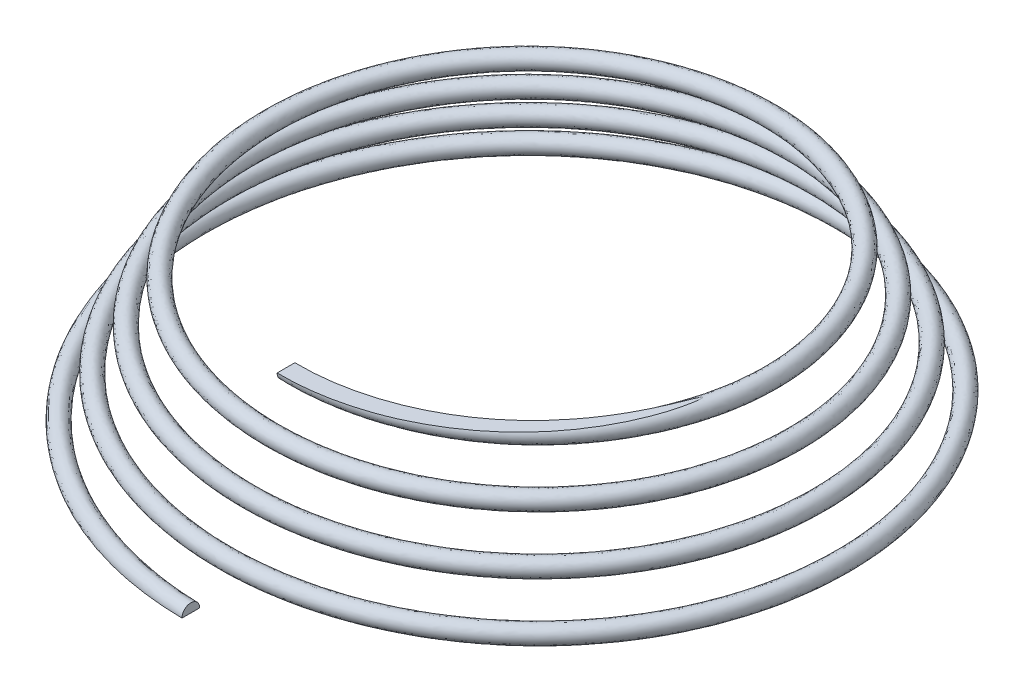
ISO-10303-21;
HEADER;
FILE_DESCRIPTION(('STEP AP214'),'2;1');
FILE_NAME('part.step','',(''),(''),'','','');
FILE_SCHEMA(('AUTOMOTIVE_DESIGN { 1 0 10303 214 1 1 1 1 }'));
ENDSEC;
DATA;
#1=APPLICATION_CONTEXT('core data for automotive mechanical design processes');
#2=APPLICATION_PROTOCOL_DEFINITION('international standard','automotive_design',2000,#1);
#3=PRODUCT_CONTEXT('',#1,'mechanical');
#4=PRODUCT('Part','Part','',(#3));
#5=PRODUCT_RELATED_PRODUCT_CATEGORY('part','',(#4));
#6=PRODUCT_DEFINITION_FORMATION('','',#4);
#7=PRODUCT_DEFINITION_CONTEXT('part definition',#1,'design');
#8=PRODUCT_DEFINITION('design','',#6,#7);
#9=PRODUCT_DEFINITION_SHAPE('','',#8);
#10=(LENGTH_UNIT() NAMED_UNIT(*) SI_UNIT(.MILLI.,.METRE.));
#11=(NAMED_UNIT(*) PLANE_ANGLE_UNIT() SI_UNIT($,.RADIAN.));
#12=(NAMED_UNIT(*) SI_UNIT($,.STERADIAN.) SOLID_ANGLE_UNIT());
#13=UNCERTAINTY_MEASURE_WITH_UNIT(LENGTH_MEASURE(1.E-05),#10,'distance_accuracy_value','');
#14=(GEOMETRIC_REPRESENTATION_CONTEXT(3) GLOBAL_UNCERTAINTY_ASSIGNED_CONTEXT((#13)) GLOBAL_UNIT_ASSIGNED_CONTEXT((#10,
#11,#12)) REPRESENTATION_CONTEXT('',''));
#15=CARTESIAN_POINT('',(0.,0.,0.));
#16=DIRECTION('',(0.,0.,1.));
#17=DIRECTION('',(1.,0.,0.));
#18=AXIS2_PLACEMENT_3D('',#15,#16,#17);
#19=CARTESIAN_POINT('',(0.,0.,13.));
#20=DIRECTION('',(1.,0.,0.));
#21=DIRECTION('',(0.,0.,-1.));
#22=AXIS2_PLACEMENT_3D('',#19,#20,#21);
#23=PLANE('',#22);
#24=DIRECTION('',(0.,0.,1.));
#25=VECTOR('',#24,1.);
#26=CARTESIAN_POINT('',(0.,0.,13.));
#27=LINE('',#26,#25);
#28=CARTESIAN_POINT('',(0.,0.,12.65));
#29=VERTEX_POINT('',#28);
#30=CARTESIAN_POINT('',(0.,0.,13.35));
#31=VERTEX_POINT('',#30);
#32=EDGE_CURVE('E53',#29,#31,#27,.T.);
#33=ORIENTED_EDGE('',*,*,#32,.F.);
#34=CARTESIAN_POINT('',(0.,0.,13.));
#35=DIRECTION('',(1.,0.,0.));
#36=DIRECTION('',(0.,0.,-1.));
#37=AXIS2_PLACEMENT_3D('',#34,#35,#36);
#38=CIRCLE('',#37,0.349999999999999);
#39=EDGE_CURVE('E67',#29,#31,#38,.T.);
#40=ORIENTED_EDGE('',*,*,#39,.T.);
#41=EDGE_LOOP('',(#33,#40));
#42=FACE_BOUND('',#41,.T.);
#43=ADVANCED_FACE('F26',(#42),#23,.T.);
#44=CARTESIAN_POINT('',(-5.16947595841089E-13,6.5,9.24722325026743));
#45=DIRECTION('',(1.,0.,0.));
#46=DIRECTION('',(0.,0.,-1.));
#47=AXIS2_PLACEMENT_3D('',#44,#45,#46);
#48=PLANE('',#47);
#49=CARTESIAN_POINT('',(-5.16947595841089E-13,6.5,9.24722325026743));
#50=DIRECTION('',(1.,0.,0.));
#51=DIRECTION('',(0.,0.,-1.));
#52=AXIS2_PLACEMENT_3D('',#49,#50,#51);
#53=CIRCLE('',#52,0.349999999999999);
#54=CARTESIAN_POINT('',(-5.36029554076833E-13,6.5,9.59722325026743));
#55=VERTEX_POINT('',#54);
#56=CARTESIAN_POINT('',(3.95824865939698E-10,6.5,8.89722325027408));
#57=VERTEX_POINT('',#56);
#58=EDGE_CURVE('E64',#55,#57,#53,.T.);
#59=ORIENTED_EDGE('',*,*,#58,.F.);
#60=DIRECTION('',(0.,0.,-1.));
#61=VECTOR('',#60,1.);
#62=CARTESIAN_POINT('',(-5.16947595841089E-13,6.5,9.24722325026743));
#63=LINE('',#62,#61);
#64=EDGE_CURVE('E47',#55,#57,#63,.T.);
#65=ORIENTED_EDGE('',*,*,#64,.T.);
#66=EDGE_LOOP('',(#59,#65));
#67=FACE_BOUND('',#66,.T.);
#68=ADVANCED_FACE('F63',(#67),#48,.F.);
#69=CARTESIAN_POINT('',(0.,0.,12.65));
#70=CARTESIAN_POINT('',(-1.65588937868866,0.0338541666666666,12.6304539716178));
#71=CARTESIAN_POINT('',(-3.30324614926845,0.0677083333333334,12.2816995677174));
#72=CARTESIAN_POINT('',(-6.33376576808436,0.135416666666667,10.9841053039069));
#73=CARTESIAN_POINT('',(-7.71576918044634,0.169270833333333,10.035823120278));
#74=CARTESIAN_POINT('',(-10.0081815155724,0.236979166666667,7.6881275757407));
#75=CARTESIAN_POINT('',(-10.9177481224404,0.270833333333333,6.28966378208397));
#76=CARTESIAN_POINT('',(-12.1313621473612,0.338541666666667,3.25759029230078));
#77=CARTESIAN_POINT('',(-12.4349970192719,0.372395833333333,1.6251747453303));
#78=CARTESIAN_POINT('',(-12.3959058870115,0.440104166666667,-1.62517474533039));
#79=CARTESIAN_POINT('',(-12.0532557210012,0.473958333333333,-3.24185349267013));
#80=CARTESIAN_POINT('',(-10.7791599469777,0.541666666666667,-6.21564273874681));
#81=CARTESIAN_POINT('',(-9.84826247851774,0.575520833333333,-7.57162808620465));
#82=CARTESIAN_POINT('',(-7.54398648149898,0.643229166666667,-9.82062087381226));
#83=CARTESIAN_POINT('',(-6.17154075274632,0.677083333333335,-10.7128027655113));
#84=CARTESIAN_POINT('',(-3.19619763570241,0.744791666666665,-11.9029183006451));
#85=CARTESIAN_POINT('',(-1.59447248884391,0.778645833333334,-12.2004484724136));
#86=CARTESIAN_POINT('',(1.59447248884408,0.846354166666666,-12.1613573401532));
#87=CARTESIAN_POINT('',(3.18046083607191,0.880208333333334,-11.824811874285));
#88=CARTESIAN_POINT('',(6.09751970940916,0.947916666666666,-10.5742145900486));
#89=CARTESIAN_POINT('',(7.42748699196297,0.981770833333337,-9.6607018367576));
#90=CARTESIAN_POINT('',(9.63306023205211,1.04947916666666,-7.39984538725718));
#91=CARTESIAN_POINT('',(10.5078574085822,1.08333333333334,-6.05341772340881));
#92=CARTESIAN_POINT('',(11.674474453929,1.15104166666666,-3.13480497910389));
#93=CARTESIAN_POINT('',(11.9658999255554,1.18489583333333,-1.56377023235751));
#94=CARTESIAN_POINT('',(11.9268087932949,1.25260416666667,1.56377023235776));
#95=CARTESIAN_POINT('',(11.5963680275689,1.28645833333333,3.11906817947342));
#96=CARTESIAN_POINT('',(10.3692692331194,1.35416666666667,5.97939668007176));
#97=CARTESIAN_POINT('',(9.47314119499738,1.38802083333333,7.28334589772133));
#98=CARTESIAN_POINT('',(7.25570429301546,1.45572916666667,9.44549959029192));
#99=CARTESIAN_POINT('',(5.93529469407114,1.48958333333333,10.3029120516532));
#100=CARTESIAN_POINT('',(3.07341232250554,1.55729166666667,11.4460306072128));
#101=CARTESIAN_POINT('',(1.53306797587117,1.59114583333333,11.7313513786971));
#102=CARTESIAN_POINT('',(-1.5330679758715,1.65885416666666,11.6922602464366));
#103=CARTESIAN_POINT('',(-3.05767552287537,1.69270833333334,11.3679241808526));
#104=CARTESIAN_POINT('',(-5.86127365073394,1.76041666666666,10.1643238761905));
#105=CARTESIAN_POINT('',(-7.13920480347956,1.79427083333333,9.28558055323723));
#106=CARTESIAN_POINT('',(-9.25793894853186,1.86197916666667,7.11156319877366));
#107=CARTESIAN_POINT('',(-10.0979666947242,1.89583333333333,5.81717166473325));
#108=CARTESIAN_POINT('',(-11.2175867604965,1.96354166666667,3.01201966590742));
#109=CARTESIAN_POINT('',(-11.4968028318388,1.99739583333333,1.50236571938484));
#110=CARTESIAN_POINT('',(-11.4577116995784,2.06510416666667,-1.50236571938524));
#111=CARTESIAN_POINT('',(-11.1394803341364,2.09895833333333,-2.99628286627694));
#112=CARTESIAN_POINT('',(-9.95937851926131,2.16666666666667,-5.7431506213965));
#113=CARTESIAN_POINT('',(-9.09801991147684,2.20052083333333,-6.99506370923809));
#114=CARTESIAN_POINT('',(-6.9674221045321,2.26822916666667,-9.0703783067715));
#115=CARTESIAN_POINT('',(-5.69904863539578,2.30208333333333,-9.89302133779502));
#116=CARTESIAN_POINT('',(-2.95062700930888,2.36979166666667,-10.9891429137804));
#117=CARTESIAN_POINT('',(-1.47166346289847,2.40364583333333,-11.2622542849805));
#118=CARTESIAN_POINT('',(1.47166346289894,2.47135416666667,-11.2231631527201));
#119=CARTESIAN_POINT('',(2.93489020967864,2.50520833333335,-10.9110364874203));
#120=CARTESIAN_POINT('',(5.62502759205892,2.57291666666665,-9.75443316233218));
#121=CARTESIAN_POINT('',(6.85092261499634,2.60677083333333,-8.91045926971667));
#122=CARTESIAN_POINT('',(8.88281766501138,2.67447916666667,-6.82328101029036));
#123=CARTESIAN_POINT('',(9.68807598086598,2.70833333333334,-5.58092560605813));
#124=CARTESIAN_POINT('',(10.7606990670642,2.77604166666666,-2.88923435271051));
#125=CARTESIAN_POINT('',(11.0277057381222,2.80989583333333,-1.44096120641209));
#126=CARTESIAN_POINT('',(10.9886146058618,2.87760416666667,1.44096120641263));
#127=CARTESIAN_POINT('',(10.6825926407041,2.91145833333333,2.87349755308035));
#128=CARTESIAN_POINT('',(9.54948780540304,2.97916666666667,5.50690456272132));
#129=CARTESIAN_POINT('',(8.72289862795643,3.01302083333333,6.70678152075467));
#130=CARTESIAN_POINT('',(6.67913991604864,3.08072916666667,8.69525702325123));
#131=CARTESIAN_POINT('',(5.46280257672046,3.11458333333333,9.48313062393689));
#132=CARTESIAN_POINT('',(2.82784169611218,3.18229166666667,10.5322552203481));
#133=CARTESIAN_POINT('',(1.41025894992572,3.21614583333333,10.7931571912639));
#134=CARTESIAN_POINT('',(-1.41025894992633,3.28385416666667,10.7540660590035));
#135=CARTESIAN_POINT('',(-2.81210489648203,3.31770833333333,10.4541487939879));
#136=CARTESIAN_POINT('',(-5.38878153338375,3.38541666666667,9.34454244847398));
#137=CARTESIAN_POINT('',(-6.56264042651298,3.41927083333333,8.53533798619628));
#138=CARTESIAN_POINT('',(-8.50769638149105,3.48697916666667,6.53499882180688));
#139=CARTESIAN_POINT('',(-9.27818526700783,3.52083333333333,5.34467954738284));
#140=CARTESIAN_POINT('',(-10.3038113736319,3.58854166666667,2.7664490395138));
#141=CARTESIAN_POINT('',(-10.5586086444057,3.62239583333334,1.37955669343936));
#142=CARTESIAN_POINT('',(-10.5195175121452,3.69010416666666,-1.37955669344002));
#143=CARTESIAN_POINT('',(-10.2257049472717,3.72395833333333,-2.75071223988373));
#144=CARTESIAN_POINT('',(-9.13959709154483,3.79166666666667,-5.27065850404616));
#145=CARTESIAN_POINT('',(-8.34777734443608,3.82552083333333,-6.41849933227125));
#146=CARTESIAN_POINT('',(-6.39085772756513,3.89322916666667,-8.32013573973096));
#147=CARTESIAN_POINT('',(-5.2265565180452,3.92708333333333,-9.07323991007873));
#148=CARTESIAN_POINT('',(-2.70505638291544,3.99479166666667,-10.0753675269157));
#149=CARTESIAN_POINT('',(-1.34885443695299,4.02864583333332,-10.3240600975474));
#150=CARTESIAN_POINT('',(1.34885443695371,4.09635416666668,-10.2849689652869));
#151=CARTESIAN_POINT('',(2.68931958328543,4.13020833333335,-9.99726110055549));
#152=CARTESIAN_POINT('',(5.1525354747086,4.19791666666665,-8.93465173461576));
#153=CARTESIAN_POINT('',(6.27435823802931,4.23177083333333,-8.16021670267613));
#154=CARTESIAN_POINT('',(8.13257509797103,4.29947916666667,-6.24671663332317));
#155=CARTESIAN_POINT('',(8.86829455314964,4.33333333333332,-5.10843348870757));
#156=CARTESIAN_POINT('',(9.84692368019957,4.40104166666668,-2.64366372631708));
#157=CARTESIAN_POINT('',(10.0895115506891,4.43489583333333,-1.318152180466));
#158=CARTESIAN_POINT('',(10.0504204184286,4.50260416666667,1.31815218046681));
#159=CARTESIAN_POINT('',(9.76881725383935,4.53645833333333,2.6279269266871));
#160=CARTESIAN_POINT('',(8.72970637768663,4.60416666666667,5.03441244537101));
#161=CARTESIAN_POINT('',(7.97265606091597,4.63802083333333,6.13021714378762));
#162=CARTESIAN_POINT('',(6.10257553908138,4.70572916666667,7.94501445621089));
#163=CARTESIAN_POINT('',(4.99031045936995,4.73958333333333,8.66334919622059));
#164=CARTESIAN_POINT('',(2.58227106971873,4.80729166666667,9.61847983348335));
#165=CARTESIAN_POINT('',(1.28744992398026,4.84114583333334,9.85496300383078));
#166=CARTESIAN_POINT('',(-1.28744992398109,4.90885416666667,9.81587187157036));
#167=CARTESIAN_POINT('',(-2.56653427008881,4.94270833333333,9.54037340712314));
#168=CARTESIAN_POINT('',(-4.91628941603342,5.01041666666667,8.52476102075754));
#169=CARTESIAN_POINT('',(-5.98607604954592,5.04427083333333,7.78509541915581));
#170=CARTESIAN_POINT('',(-7.75745381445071,5.11197916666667,5.95843444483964));
#171=CARTESIAN_POINT('',(-8.45840383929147,5.14583333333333,4.87218743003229));
#172=CARTESIAN_POINT('',(-9.39003598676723,5.21354166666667,2.52087841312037));
#173=CARTESIAN_POINT('',(-9.62041445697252,5.24739583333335,1.25674766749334));
#174=CARTESIAN_POINT('',(-9.58132332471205,5.31510416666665,-1.25674766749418));
#175=CARTESIAN_POINT('',(-9.31192956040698,5.34895833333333,-2.50514161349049));
#176=CARTESIAN_POINT('',(-8.31981566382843,5.41666666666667,-4.79816638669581));
#177=CARTESIAN_POINT('',(-7.59753477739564,5.45052083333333,-5.84193495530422));
#178=CARTESIAN_POINT('',(-4.92267263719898,5.55208333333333,-8.43387228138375));
#179=CARTESIAN_POINT('',(-2.45209082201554,5.61979166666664,-9.40541147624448));
#180=CARTESIAN_POINT('',(2.45209082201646,5.75520833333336,-9.32722921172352));
#181=CARTESIAN_POINT('',(4.85552452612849,5.8229166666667,-8.27988507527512));
#182=CARTESIAN_POINT('',(8.22460186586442,5.95833333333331,-4.80024131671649));
#183=CARTESIAN_POINT('',(9.17086292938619,6.02604166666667,-2.39068630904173));
#184=CARTESIAN_POINT('',(9.09268066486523,6.16145833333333,2.39068630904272));
#185=CARTESIAN_POINT('',(8.07061465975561,6.22916666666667,4.73309320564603));
#186=CARTESIAN_POINT('',(4.67780999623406,6.36458333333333,8.01533145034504));
#187=CARTESIAN_POINT('',(2.32929921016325,6.43229166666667,8.93631522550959));
#188=CARTESIAN_POINT('',(-4.96998275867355E-13,6.5,8.89722325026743));
#189=CARTESIAN_POINT('',(0.,0.699999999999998,12.65));
#190=CARTESIAN_POINT('',(-1.65588937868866,0.733854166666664,12.6304539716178));
#191=CARTESIAN_POINT('',(-3.30324614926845,0.767708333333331,12.2816995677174));
#192=CARTESIAN_POINT('',(-6.33376576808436,0.835416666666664,10.9841053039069));
#193=CARTESIAN_POINT('',(-7.71576918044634,0.869270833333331,10.035823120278));
#194=CARTESIAN_POINT('',(-10.0081815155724,0.936979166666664,7.6881275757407));
#195=CARTESIAN_POINT('',(-10.9177481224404,0.970833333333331,6.28966378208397));
#196=CARTESIAN_POINT('',(-12.1313621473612,1.03854166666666,3.25759029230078));
#197=CARTESIAN_POINT('',(-12.4349970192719,1.07239583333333,1.6251747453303));
#198=CARTESIAN_POINT('',(-12.3959058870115,1.14010416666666,-1.62517474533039));
#199=CARTESIAN_POINT('',(-12.0532557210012,1.17395833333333,-3.24185349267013));
#200=CARTESIAN_POINT('',(-10.7791599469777,1.24166666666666,-6.21564273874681));
#201=CARTESIAN_POINT('',(-9.84826247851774,1.27552083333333,-7.57162808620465));
#202=CARTESIAN_POINT('',(-7.54398648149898,1.34322916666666,-9.82062087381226));
#203=CARTESIAN_POINT('',(-6.17154075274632,1.37708333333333,-10.7128027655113));
#204=CARTESIAN_POINT('',(-3.19619763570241,1.44479166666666,-11.9029183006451));
#205=CARTESIAN_POINT('',(-1.59447248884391,1.47864583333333,-12.2004484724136));
#206=CARTESIAN_POINT('',(1.59447248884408,1.54635416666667,-12.1613573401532));
#207=CARTESIAN_POINT('',(3.18046083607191,1.58020833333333,-11.824811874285));
#208=CARTESIAN_POINT('',(6.09751970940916,1.64791666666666,-10.5742145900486));
#209=CARTESIAN_POINT('',(7.42748699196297,1.68177083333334,-9.6607018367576));
#210=CARTESIAN_POINT('',(9.63306023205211,1.74947916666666,-7.39984538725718));
#211=CARTESIAN_POINT('',(10.5078574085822,1.78333333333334,-6.05341772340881));
#212=CARTESIAN_POINT('',(11.674474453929,1.85104166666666,-3.13480497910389));
#213=CARTESIAN_POINT('',(11.9658999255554,1.88489583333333,-1.56377023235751));
#214=CARTESIAN_POINT('',(11.9268087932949,1.95260416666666,1.56377023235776));
#215=CARTESIAN_POINT('',(11.5963680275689,1.98645833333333,3.11906817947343));
#216=CARTESIAN_POINT('',(10.3692692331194,2.05416666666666,5.97939668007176));
#217=CARTESIAN_POINT('',(9.47314119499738,2.08802083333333,7.28334589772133));
#218=CARTESIAN_POINT('',(7.25570429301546,2.15572916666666,9.44549959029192));
#219=CARTESIAN_POINT('',(5.93529469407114,2.18958333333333,10.3029120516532));
#220=CARTESIAN_POINT('',(3.07341232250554,2.25729166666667,11.4460306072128));
#221=CARTESIAN_POINT('',(1.53306797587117,2.29114583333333,11.7313513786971));
#222=CARTESIAN_POINT('',(-1.5330679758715,2.35885416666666,11.6922602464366));
#223=CARTESIAN_POINT('',(-3.05767552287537,2.39270833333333,11.3679241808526));
#224=CARTESIAN_POINT('',(-5.86127365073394,2.46041666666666,10.1643238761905));
#225=CARTESIAN_POINT('',(-7.13920480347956,2.49427083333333,9.28558055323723));
#226=CARTESIAN_POINT('',(-9.25793894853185,2.56197916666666,7.11156319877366));
#227=CARTESIAN_POINT('',(-10.0979666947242,2.59583333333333,5.81717166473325));
#228=CARTESIAN_POINT('',(-11.2175867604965,2.66354166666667,3.01201966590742));
#229=CARTESIAN_POINT('',(-11.4968028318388,2.69739583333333,1.50236571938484));
#230=CARTESIAN_POINT('',(-11.4577116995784,2.76510416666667,-1.50236571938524));
#231=CARTESIAN_POINT('',(-11.1394803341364,2.79895833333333,-2.99628286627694));
#232=CARTESIAN_POINT('',(-9.95937851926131,2.86666666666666,-5.7431506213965));
#233=CARTESIAN_POINT('',(-9.09801991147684,2.90052083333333,-6.99506370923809));
#234=CARTESIAN_POINT('',(-6.9674221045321,2.96822916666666,-9.0703783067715));
#235=CARTESIAN_POINT('',(-5.69904863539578,3.00208333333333,-9.89302133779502));
#236=CARTESIAN_POINT('',(-2.95062700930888,3.06979166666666,-10.9891429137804));
#237=CARTESIAN_POINT('',(-1.47166346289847,3.10364583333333,-11.2622542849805));
#238=CARTESIAN_POINT('',(1.47166346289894,3.17135416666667,-11.2231631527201));
#239=CARTESIAN_POINT('',(2.93489020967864,3.20520833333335,-10.9110364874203));
#240=CARTESIAN_POINT('',(5.62502759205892,3.27291666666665,-9.75443316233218));
#241=CARTESIAN_POINT('',(6.85092261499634,3.30677083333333,-8.91045926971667));
#242=CARTESIAN_POINT('',(8.88281766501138,3.37447916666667,-6.82328101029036));
#243=CARTESIAN_POINT('',(9.68807598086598,3.40833333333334,-5.58092560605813));
#244=CARTESIAN_POINT('',(10.7606990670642,3.47604166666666,-2.88923435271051));
#245=CARTESIAN_POINT('',(11.0277057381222,3.50989583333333,-1.44096120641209));
#246=CARTESIAN_POINT('',(10.9886146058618,3.57760416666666,1.44096120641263));
#247=CARTESIAN_POINT('',(10.6825926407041,3.61145833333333,2.87349755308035));
#248=CARTESIAN_POINT('',(9.54948780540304,3.67916666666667,5.50690456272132));
#249=CARTESIAN_POINT('',(8.72289862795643,3.71302083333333,6.70678152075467));
#250=CARTESIAN_POINT('',(6.67913991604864,3.78072916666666,8.69525702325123));
#251=CARTESIAN_POINT('',(5.46280257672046,3.81458333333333,9.48313062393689));
#252=CARTESIAN_POINT('',(2.82784169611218,3.88229166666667,10.5322552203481));
#253=CARTESIAN_POINT('',(1.41025894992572,3.91614583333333,10.7931571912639));
#254=CARTESIAN_POINT('',(-1.41025894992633,3.98385416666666,10.7540660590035));
#255=CARTESIAN_POINT('',(-2.81210489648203,4.01770833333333,10.4541487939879));
#256=CARTESIAN_POINT('',(-5.38878153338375,4.08541666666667,9.34454244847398));
#257=CARTESIAN_POINT('',(-6.56264042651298,4.11927083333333,8.53533798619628));
#258=CARTESIAN_POINT('',(-8.50769638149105,4.18697916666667,6.53499882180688));
#259=CARTESIAN_POINT('',(-9.27818526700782,4.22083333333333,5.34467954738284));
#260=CARTESIAN_POINT('',(-10.3038113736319,4.28854166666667,2.7664490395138));
#261=CARTESIAN_POINT('',(-10.5586086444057,4.32239583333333,1.37955669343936));
#262=CARTESIAN_POINT('',(-10.5195175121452,4.39010416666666,-1.37955669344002));
#263=CARTESIAN_POINT('',(-10.2257049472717,4.42395833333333,-2.75071223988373));
#264=CARTESIAN_POINT('',(-9.13959709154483,4.49166666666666,-5.27065850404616));
#265=CARTESIAN_POINT('',(-8.34777734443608,4.52552083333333,-6.41849933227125));
#266=CARTESIAN_POINT('',(-6.39085772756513,4.59322916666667,-8.32013573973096));
#267=CARTESIAN_POINT('',(-5.2265565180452,4.62708333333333,-9.07323991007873));
#268=CARTESIAN_POINT('',(-2.70505638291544,4.69479166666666,-10.0753675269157));
#269=CARTESIAN_POINT('',(-1.34885443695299,4.72864583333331,-10.3240600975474));
#270=CARTESIAN_POINT('',(1.34885443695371,4.79635416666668,-10.2849689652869));
#271=CARTESIAN_POINT('',(2.68931958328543,4.83020833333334,-9.99726110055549));
#272=CARTESIAN_POINT('',(5.1525354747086,4.89791666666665,-8.93465173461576));
#273=CARTESIAN_POINT('',(6.27435823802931,4.93177083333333,-8.16021670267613));
#274=CARTESIAN_POINT('',(8.13257509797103,4.99947916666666,-6.24671663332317));
#275=CARTESIAN_POINT('',(8.86829455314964,5.03333333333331,-5.10843348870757));
#276=CARTESIAN_POINT('',(9.84692368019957,5.10104166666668,-2.64366372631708));
#277=CARTESIAN_POINT('',(10.0895115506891,5.13489583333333,-1.318152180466));
#278=CARTESIAN_POINT('',(10.0504204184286,5.20260416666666,1.31815218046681));
#279=CARTESIAN_POINT('',(9.76881725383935,5.23645833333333,2.62792692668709));
#280=CARTESIAN_POINT('',(8.72970637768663,5.30416666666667,5.03441244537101));
#281=CARTESIAN_POINT('',(7.97265606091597,5.33802083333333,6.13021714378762));
#282=CARTESIAN_POINT('',(6.10257553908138,5.40572916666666,7.94501445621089));
#283=CARTESIAN_POINT('',(4.99031045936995,5.43958333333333,8.66334919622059));
#284=CARTESIAN_POINT('',(2.58227106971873,5.50729166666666,9.61847983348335));
#285=CARTESIAN_POINT('',(1.28744992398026,5.54114583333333,9.85496300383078));
#286=CARTESIAN_POINT('',(-1.28744992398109,5.60885416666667,9.81587187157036));
#287=CARTESIAN_POINT('',(-2.56653427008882,5.64270833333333,9.54037340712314));
#288=CARTESIAN_POINT('',(-4.91628941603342,5.71041666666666,8.52476102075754));
#289=CARTESIAN_POINT('',(-5.98607604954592,5.74427083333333,7.78509541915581));
#290=CARTESIAN_POINT('',(-7.75745381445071,5.81197916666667,5.95843444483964));
#291=CARTESIAN_POINT('',(-8.45840383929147,5.84583333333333,4.87218743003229));
#292=CARTESIAN_POINT('',(-9.39003598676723,5.91354166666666,2.52087841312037));
#293=CARTESIAN_POINT('',(-9.62041445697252,5.94739583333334,1.25674766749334));
#294=CARTESIAN_POINT('',(-9.58132332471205,6.01510416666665,-1.25674766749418));
#295=CARTESIAN_POINT('',(-9.31192956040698,6.04895833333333,-2.50514161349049));
#296=CARTESIAN_POINT('',(-8.31981566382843,6.11666666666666,-4.79816638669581));
#297=CARTESIAN_POINT('',(-7.59753477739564,6.15052083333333,-5.84193495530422));
#298=CARTESIAN_POINT('',(-4.92267263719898,6.25208333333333,-8.43387228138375));
#299=CARTESIAN_POINT('',(-2.45209082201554,6.31979166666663,-9.40541147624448));
#300=CARTESIAN_POINT('',(2.45209082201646,6.45520833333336,-9.32722921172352));
#301=CARTESIAN_POINT('',(4.85552452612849,6.52291666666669,-8.27988507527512));
#302=CARTESIAN_POINT('',(8.22460186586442,6.6583333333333,-4.80024131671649));
#303=CARTESIAN_POINT('',(9.17086292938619,6.72604166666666,-2.39068630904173));
#304=CARTESIAN_POINT('',(9.09268066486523,6.86145833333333,2.39068630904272));
#305=CARTESIAN_POINT('',(8.07061465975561,6.92916666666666,4.73309320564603));
#306=CARTESIAN_POINT('',(4.67780999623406,7.06458333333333,8.01533145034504));
#307=CARTESIAN_POINT('',(2.32929921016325,7.13229166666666,8.93631522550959));
#308=CARTESIAN_POINT('',(-4.96998275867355E-13,7.2,8.89722325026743));
#309=CARTESIAN_POINT('',(0.,0.699999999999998,13.35));
#310=CARTESIAN_POINT('',(-1.74751962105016,0.733854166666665,13.3304539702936));
#311=CARTESIAN_POINT('',(-3.48646987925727,0.76770833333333,12.9634803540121));
#312=CARTESIAN_POINT('',(-6.68629884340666,0.835416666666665,11.595755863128));
#313=CARTESIAN_POINT('',(-8.14595204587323,0.869270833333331,10.5955897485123));
#314=CARTESIAN_POINT('',(-10.5679481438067,0.936979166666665,8.11831044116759));
#315=CARTESIAN_POINT('',(-11.5293986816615,0.970833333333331,6.64219685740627));
#316=CARTESIAN_POINT('',(-12.8131429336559,1.03854166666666,3.44081402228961));
#317=CARTESIAN_POINT('',(-13.1349970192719,1.07239583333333,1.71680430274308));
#318=CARTESIAN_POINT('',(-13.0959058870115,1.14010416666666,-1.71680430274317));
#319=CARTESIAN_POINT('',(-12.7350365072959,1.17395833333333,-3.42507722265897));
#320=CARTESIAN_POINT('',(-11.3908105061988,1.24166666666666,-6.5681758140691));
#321=CARTESIAN_POINT('',(-10.408029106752,1.27552083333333,-8.00181095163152));
#322=CARTESIAN_POINT('',(-7.97416934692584,1.34322916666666,-10.3803875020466));
#323=CARTESIAN_POINT('',(-6.52407382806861,1.37708333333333,-11.3244533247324));
#324=CARTESIAN_POINT('',(-3.37942136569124,1.44479166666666,-12.5846990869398));
#325=CARTESIAN_POINT('',(-1.68610204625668,1.47864583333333,-12.9004484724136));
#326=CARTESIAN_POINT('',(1.68610204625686,1.54635416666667,-12.8613573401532));
#327=CARTESIAN_POINT('',(3.36368456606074,1.58020833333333,-12.5065926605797));
#328=CARTESIAN_POINT('',(6.45005278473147,1.64791666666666,-11.1858651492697));
#329=CARTESIAN_POINT('',(7.85766985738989,1.68177083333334,-10.2204684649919));
#330=CARTESIAN_POINT('',(10.1928268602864,1.74947916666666,-7.83002825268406));
#331=CARTESIAN_POINT('',(11.1195079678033,1.78333333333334,-6.40595079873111));
#332=CARTESIAN_POINT('',(12.3562552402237,1.85104166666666,-3.31802870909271));
#333=CARTESIAN_POINT('',(12.6658999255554,1.88489583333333,-1.65539978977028));
#334=CARTESIAN_POINT('',(12.6268087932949,1.95260416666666,1.65539978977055));
#335=CARTESIAN_POINT('',(12.2781488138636,1.98645833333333,3.30229190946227));
#336=CARTESIAN_POINT('',(10.9809197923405,2.05416666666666,6.33192975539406));
#337=CARTESIAN_POINT('',(10.0329078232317,2.08802083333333,7.71352876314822));
#338=CARTESIAN_POINT('',(7.68588715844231,2.15572916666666,10.0052662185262));
#339=CARTESIAN_POINT('',(6.28782776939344,2.18958333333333,10.9145626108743));
#340=CARTESIAN_POINT('',(3.25663605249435,2.25729166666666,12.1278113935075));
#341=CARTESIAN_POINT('',(1.62469753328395,2.29114583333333,12.4313513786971));
#342=CARTESIAN_POINT('',(-1.62469753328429,2.35885416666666,12.3922602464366));
#343=CARTESIAN_POINT('',(-3.24089925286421,2.39270833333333,12.0497049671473));
#344=CARTESIAN_POINT('',(-6.21380672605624,2.46041666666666,10.7759744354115));
#345=CARTESIAN_POINT('',(-7.56938766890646,2.49427083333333,9.84534718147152));
#346=CARTESIAN_POINT('',(-9.81770557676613,2.56197916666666,7.54174606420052));
#347=CARTESIAN_POINT('',(-10.7096172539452,2.59583333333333,6.16970474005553));
#348=CARTESIAN_POINT('',(-11.8993675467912,2.66354166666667,3.19524339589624));
#349=CARTESIAN_POINT('',(-12.1968028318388,2.69739583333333,1.59399527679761));
#350=CARTESIAN_POINT('',(-12.1577116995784,2.76510416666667,-1.59399527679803));
#351=CARTESIAN_POINT('',(-11.8212611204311,2.79895833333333,-3.17950659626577));
#352=CARTESIAN_POINT('',(-10.5710290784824,2.86666666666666,-6.09568369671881));
#353=CARTESIAN_POINT('',(-9.6577865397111,2.90052083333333,-7.425246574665));
#354=CARTESIAN_POINT('',(-7.39760496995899,2.96822916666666,-9.63014493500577));
#355=CARTESIAN_POINT('',(-6.05158171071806,3.00208333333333,-10.5046718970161));
#356=CARTESIAN_POINT('',(-3.1338507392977,3.06979166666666,-11.6709237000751));
#357=CARTESIAN_POINT('',(-1.56329302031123,3.10364583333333,-11.9622542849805));
#358=CARTESIAN_POINT('',(1.56329302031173,3.17135416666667,-11.9231631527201));
#359=CARTESIAN_POINT('',(3.11811393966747,3.20520833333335,-11.592817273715));
#360=CARTESIAN_POINT('',(5.97756066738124,3.27291666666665,-10.3660837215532));
#361=CARTESIAN_POINT('',(7.28110548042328,3.30677083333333,-9.47022589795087));
#362=CARTESIAN_POINT('',(9.44258429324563,3.37447916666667,-7.25346387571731));
#363=CARTESIAN_POINT('',(10.2997265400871,3.40833333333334,-5.93345868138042));
#364=CARTESIAN_POINT('',(11.4424798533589,3.47604166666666,-3.07245808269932));
#365=CARTESIAN_POINT('',(11.7277057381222,3.50989583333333,-1.53259076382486));
#366=CARTESIAN_POINT('',(11.6886146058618,3.57760416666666,1.53259076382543));
#367=CARTESIAN_POINT('',(11.3643734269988,3.61145833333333,3.05672128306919));
#368=CARTESIAN_POINT('',(10.1611383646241,3.67916666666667,5.85943763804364));
#369=CARTESIAN_POINT('',(9.2826652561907,3.71302083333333,7.13696438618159));
#370=CARTESIAN_POINT('',(7.10932278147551,3.78072916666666,9.25502365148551));
#371=CARTESIAN_POINT('',(5.81533565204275,3.81458333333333,10.094781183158));
#372=CARTESIAN_POINT('',(3.01106542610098,3.88229166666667,11.2140360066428));
#373=CARTESIAN_POINT('',(1.50188850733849,3.91614583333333,11.4931571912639));
#374=CARTESIAN_POINT('',(-1.50188850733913,3.98385416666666,11.4540660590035));
#375=CARTESIAN_POINT('',(-2.99532862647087,4.01770833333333,11.1359295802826));
#376=CARTESIAN_POINT('',(-5.74131460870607,4.08541666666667,9.95619300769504));
#377=CARTESIAN_POINT('',(-6.99282329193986,4.11927083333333,9.09510461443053));
#378=CARTESIAN_POINT('',(-9.06746300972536,4.18697916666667,6.96518168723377));
#379=CARTESIAN_POINT('',(-9.88983582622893,4.22083333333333,5.69721262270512));
#380=CARTESIAN_POINT('',(-10.9855921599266,4.28854166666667,2.9496727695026));
#381=CARTESIAN_POINT('',(-11.2586086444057,4.32239583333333,1.47118625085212));
#382=CARTESIAN_POINT('',(-11.2195175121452,4.39010416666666,-1.47118625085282));
#383=CARTESIAN_POINT('',(-10.9074857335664,4.42395833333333,-2.93393596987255));
#384=CARTESIAN_POINT('',(-9.75124765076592,4.49166666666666,-5.62319157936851));
#385=CARTESIAN_POINT('',(-8.90754397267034,4.52552083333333,-6.84868219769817));
#386=CARTESIAN_POINT('',(-6.821040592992,4.59322916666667,-8.87990236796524));
#387=CARTESIAN_POINT('',(-5.57908959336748,4.62708333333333,-9.68489046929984));
#388=CARTESIAN_POINT('',(-2.88828011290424,4.69479166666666,-10.7571483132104));
#389=CARTESIAN_POINT('',(-1.44048399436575,4.72864583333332,-11.0240600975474));
#390=CARTESIAN_POINT('',(1.44048399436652,4.79635416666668,-10.9849689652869));
#391=CARTESIAN_POINT('',(2.87254331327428,4.83020833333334,-10.6790418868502));
#392=CARTESIAN_POINT('',(5.50506855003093,4.89791666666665,-9.54630229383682));
#393=CARTESIAN_POINT('',(6.70454110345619,4.93177083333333,-8.71998333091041));
#394=CARTESIAN_POINT('',(8.69234172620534,4.99947916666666,-6.67689949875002));
#395=CARTESIAN_POINT('',(9.47994511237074,5.03333333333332,-5.46096656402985));
#396=CARTESIAN_POINT('',(10.5287044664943,5.10104166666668,-2.82688745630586));
#397=CARTESIAN_POINT('',(10.7895115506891,5.13489583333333,-1.40978173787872));
#398=CARTESIAN_POINT('',(10.7504204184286,5.20260416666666,1.40978173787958));
#399=CARTESIAN_POINT('',(10.450598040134,5.23645833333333,2.81115065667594));
#400=CARTESIAN_POINT('',(9.34135693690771,5.30416666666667,5.38694552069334));
#401=CARTESIAN_POINT('',(8.53242268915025,5.33802083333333,6.56040000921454));
#402=CARTESIAN_POINT('',(6.53275840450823,5.40572916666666,8.50478108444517));
#403=CARTESIAN_POINT('',(5.34284353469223,5.43958333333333,9.27499975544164));
#404=CARTESIAN_POINT('',(2.76549479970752,5.50729166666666,10.3002606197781));
#405=CARTESIAN_POINT('',(1.37907948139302,5.54114583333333,10.5549630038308));
#406=CARTESIAN_POINT('',(-1.3790794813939,5.60885416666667,10.5158718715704));
#407=CARTESIAN_POINT('',(-2.74975800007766,5.64270833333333,10.2221541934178));
#408=CARTESIAN_POINT('',(-5.26882249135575,5.71041666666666,9.13641157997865));
#409=CARTESIAN_POINT('',(-6.41625891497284,5.74427083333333,8.34486204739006));
#410=CARTESIAN_POINT('',(-8.31722044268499,5.81197916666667,6.38861731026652));
#411=CARTESIAN_POINT('',(-9.07005439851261,5.84583333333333,5.22472050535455));
#412=CARTESIAN_POINT('',(-10.0718167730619,5.91354166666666,2.70410214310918));
#413=CARTESIAN_POINT('',(-10.3204144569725,5.94739583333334,1.34837722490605));
#414=CARTESIAN_POINT('',(-10.281323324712,6.01510416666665,-1.34837722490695));
#415=CARTESIAN_POINT('',(-9.99371034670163,6.04895833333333,-2.68836534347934));
#416=CARTESIAN_POINT('',(-8.93146622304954,6.11666666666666,-5.15069946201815));
#417=CARTESIAN_POINT('',(-8.15730140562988,6.15052083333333,-6.27211782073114));
#418=CARTESIAN_POINT('',(-5.28806362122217,6.25208333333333,-9.05843079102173));
#419=CARTESIAN_POINT('',(-2.63534993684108,6.31979166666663,-10.1054114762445));
#420=CARTESIAN_POINT('',(2.63534993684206,6.45520833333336,-10.0272292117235));
#421=CARTESIAN_POINT('',(5.22091551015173,6.52291666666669,-8.90444358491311));
#422=CARTESIAN_POINT('',(8.84916037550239,6.6583333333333,-5.16563230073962));
#423=CARTESIAN_POINT('',(9.87086292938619,6.72604166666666,-2.57394542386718));
#424=CARTESIAN_POINT('',(9.79268066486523,6.86145833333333,2.57394542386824));
#425=CARTESIAN_POINT('',(8.69517316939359,6.92916666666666,5.09848418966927));
#426=CARTESIAN_POINT('',(5.04320098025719,7.06458333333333,8.63988995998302));
#427=CARTESIAN_POINT('',(2.51255969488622,7.13229166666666,9.63631522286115));
#428=CARTESIAN_POINT('',(-5.36029554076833E-13,7.2,9.59722325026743));
#429=CARTESIAN_POINT('',(0.,0.,13.35));
#430=CARTESIAN_POINT('',(-1.74751962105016,0.0338541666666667,13.3304539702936));
#431=CARTESIAN_POINT('',(-3.48646987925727,0.0677083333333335,12.9634803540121));
#432=CARTESIAN_POINT('',(-6.68629884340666,0.135416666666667,11.595755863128));
#433=CARTESIAN_POINT('',(-8.14595204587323,0.169270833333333,10.5955897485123));
#434=CARTESIAN_POINT('',(-10.5679481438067,0.236979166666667,8.11831044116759));
#435=CARTESIAN_POINT('',(-11.5293986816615,0.270833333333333,6.64219685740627));
#436=CARTESIAN_POINT('',(-12.8131429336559,0.338541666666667,3.44081402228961));
#437=CARTESIAN_POINT('',(-13.1349970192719,0.372395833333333,1.71680430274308));
#438=CARTESIAN_POINT('',(-13.0959058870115,0.440104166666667,-1.71680430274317));
#439=CARTESIAN_POINT('',(-12.7350365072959,0.473958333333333,-3.42507722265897));
#440=CARTESIAN_POINT('',(-11.3908105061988,0.541666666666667,-6.5681758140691));
#441=CARTESIAN_POINT('',(-10.408029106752,0.575520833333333,-8.00181095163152));
#442=CARTESIAN_POINT('',(-7.97416934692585,0.643229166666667,-10.3803875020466));
#443=CARTESIAN_POINT('',(-6.52407382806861,0.677083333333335,-11.3244533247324));
#444=CARTESIAN_POINT('',(-3.37942136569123,0.744791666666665,-12.5846990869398));
#445=CARTESIAN_POINT('',(-1.68610204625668,0.778645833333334,-12.9004484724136));
#446=CARTESIAN_POINT('',(1.68610204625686,0.846354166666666,-12.8613573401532));
#447=CARTESIAN_POINT('',(3.36368456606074,0.880208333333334,-12.5065926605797));
#448=CARTESIAN_POINT('',(6.45005278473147,0.947916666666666,-11.1858651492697));
#449=CARTESIAN_POINT('',(7.85766985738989,0.981770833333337,-10.2204684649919));
#450=CARTESIAN_POINT('',(10.1928268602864,1.04947916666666,-7.83002825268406));
#451=CARTESIAN_POINT('',(11.1195079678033,1.08333333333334,-6.40595079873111));
#452=CARTESIAN_POINT('',(12.3562552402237,1.15104166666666,-3.31802870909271));
#453=CARTESIAN_POINT('',(12.6658999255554,1.18489583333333,-1.65539978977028));
#454=CARTESIAN_POINT('',(12.6268087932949,1.25260416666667,1.65539978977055));
#455=CARTESIAN_POINT('',(12.2781488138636,1.28645833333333,3.30229190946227));
#456=CARTESIAN_POINT('',(10.9809197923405,1.35416666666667,6.33192975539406));
#457=CARTESIAN_POINT('',(10.0329078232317,1.38802083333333,7.71352876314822));
#458=CARTESIAN_POINT('',(7.68588715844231,1.45572916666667,10.0052662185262));
#459=CARTESIAN_POINT('',(6.28782776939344,1.48958333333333,10.9145626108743));
#460=CARTESIAN_POINT('',(3.25663605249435,1.55729166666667,12.1278113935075));
#461=CARTESIAN_POINT('',(1.62469753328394,1.59114583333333,12.4313513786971));
#462=CARTESIAN_POINT('',(-1.62469753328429,1.65885416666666,12.3922602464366));
#463=CARTESIAN_POINT('',(-3.24089925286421,1.69270833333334,12.0497049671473));
#464=CARTESIAN_POINT('',(-6.21380672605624,1.76041666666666,10.7759744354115));
#465=CARTESIAN_POINT('',(-7.56938766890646,1.79427083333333,9.84534718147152));
#466=CARTESIAN_POINT('',(-9.81770557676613,1.86197916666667,7.54174606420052));
#467=CARTESIAN_POINT('',(-10.7096172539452,1.89583333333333,6.16970474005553));
#468=CARTESIAN_POINT('',(-11.8993675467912,1.96354166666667,3.19524339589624));
#469=CARTESIAN_POINT('',(-12.1968028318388,1.99739583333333,1.59399527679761));
#470=CARTESIAN_POINT('',(-12.1577116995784,2.06510416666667,-1.59399527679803));
#471=CARTESIAN_POINT('',(-11.8212611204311,2.09895833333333,-3.17950659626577));
#472=CARTESIAN_POINT('',(-10.5710290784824,2.16666666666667,-6.09568369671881));
#473=CARTESIAN_POINT('',(-9.6577865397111,2.20052083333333,-7.425246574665));
#474=CARTESIAN_POINT('',(-7.39760496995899,2.26822916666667,-9.63014493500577));
#475=CARTESIAN_POINT('',(-6.05158171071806,2.30208333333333,-10.5046718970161));
#476=CARTESIAN_POINT('',(-3.1338507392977,2.36979166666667,-11.6709237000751));
#477=CARTESIAN_POINT('',(-1.56329302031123,2.40364583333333,-11.9622542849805));
#478=CARTESIAN_POINT('',(1.56329302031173,2.47135416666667,-11.9231631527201));
#479=CARTESIAN_POINT('',(3.11811393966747,2.50520833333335,-11.592817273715));
#480=CARTESIAN_POINT('',(5.97756066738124,2.57291666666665,-10.3660837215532));
#481=CARTESIAN_POINT('',(7.28110548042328,2.60677083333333,-9.47022589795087));
#482=CARTESIAN_POINT('',(9.44258429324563,2.67447916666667,-7.25346387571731));
#483=CARTESIAN_POINT('',(10.2997265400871,2.70833333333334,-5.93345868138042));
#484=CARTESIAN_POINT('',(11.4424798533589,2.77604166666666,-3.07245808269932));
#485=CARTESIAN_POINT('',(11.7277057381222,2.80989583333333,-1.53259076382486));
#486=CARTESIAN_POINT('',(11.6886146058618,2.87760416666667,1.53259076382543));
#487=CARTESIAN_POINT('',(11.3643734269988,2.91145833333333,3.05672128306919));
#488=CARTESIAN_POINT('',(10.1611383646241,2.97916666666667,5.85943763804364));
#489=CARTESIAN_POINT('',(9.2826652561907,3.01302083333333,7.13696438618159));
#490=CARTESIAN_POINT('',(7.10932278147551,3.08072916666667,9.25502365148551));
#491=CARTESIAN_POINT('',(5.81533565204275,3.11458333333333,10.094781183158));
#492=CARTESIAN_POINT('',(3.01106542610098,3.18229166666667,11.2140360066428));
#493=CARTESIAN_POINT('',(1.50188850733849,3.21614583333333,11.4931571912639));
#494=CARTESIAN_POINT('',(-1.50188850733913,3.28385416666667,11.4540660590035));
#495=CARTESIAN_POINT('',(-2.99532862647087,3.31770833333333,11.1359295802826));
#496=CARTESIAN_POINT('',(-5.74131460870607,3.38541666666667,9.95619300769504));
#497=CARTESIAN_POINT('',(-6.99282329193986,3.41927083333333,9.09510461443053));
#498=CARTESIAN_POINT('',(-9.06746300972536,3.48697916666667,6.96518168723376));
#499=CARTESIAN_POINT('',(-9.88983582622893,3.52083333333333,5.69721262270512));
#500=CARTESIAN_POINT('',(-10.9855921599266,3.58854166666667,2.9496727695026));
#501=CARTESIAN_POINT('',(-11.2586086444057,3.62239583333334,1.47118625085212));
#502=CARTESIAN_POINT('',(-11.2195175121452,3.69010416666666,-1.47118625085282));
#503=CARTESIAN_POINT('',(-10.9074857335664,3.72395833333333,-2.93393596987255));
#504=CARTESIAN_POINT('',(-9.75124765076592,3.79166666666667,-5.62319157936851));
#505=CARTESIAN_POINT('',(-8.90754397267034,3.82552083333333,-6.84868219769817));
#506=CARTESIAN_POINT('',(-6.821040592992,3.89322916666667,-8.87990236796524));
#507=CARTESIAN_POINT('',(-5.57908959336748,3.92708333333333,-9.68489046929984));
#508=CARTESIAN_POINT('',(-2.88828011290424,3.99479166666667,-10.7571483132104));
#509=CARTESIAN_POINT('',(-1.44048399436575,4.02864583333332,-11.0240600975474));
#510=CARTESIAN_POINT('',(1.44048399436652,4.09635416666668,-10.9849689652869));
#511=CARTESIAN_POINT('',(2.87254331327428,4.13020833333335,-10.6790418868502));
#512=CARTESIAN_POINT('',(5.50506855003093,4.19791666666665,-9.54630229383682));
#513=CARTESIAN_POINT('',(6.70454110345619,4.23177083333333,-8.71998333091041));
#514=CARTESIAN_POINT('',(8.69234172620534,4.29947916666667,-6.67689949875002));
#515=CARTESIAN_POINT('',(9.47994511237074,4.33333333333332,-5.46096656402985));
#516=CARTESIAN_POINT('',(10.5287044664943,4.40104166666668,-2.82688745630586));
#517=CARTESIAN_POINT('',(10.7895115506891,4.43489583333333,-1.40978173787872));
#518=CARTESIAN_POINT('',(10.7504204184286,4.50260416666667,1.40978173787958));
#519=CARTESIAN_POINT('',(10.450598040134,4.53645833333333,2.81115065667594));
#520=CARTESIAN_POINT('',(9.34135693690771,4.60416666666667,5.38694552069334));
#521=CARTESIAN_POINT('',(8.53242268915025,4.63802083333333,6.56040000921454));
#522=CARTESIAN_POINT('',(6.53275840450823,4.70572916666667,8.50478108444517));
#523=CARTESIAN_POINT('',(5.34284353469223,4.73958333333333,9.27499975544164));
#524=CARTESIAN_POINT('',(2.76549479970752,4.80729166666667,10.3002606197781));
#525=CARTESIAN_POINT('',(1.37907948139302,4.84114583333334,10.5549630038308));
#526=CARTESIAN_POINT('',(-1.3790794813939,4.90885416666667,10.5158718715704));
#527=CARTESIAN_POINT('',(-2.74975800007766,4.94270833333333,10.2221541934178));
#528=CARTESIAN_POINT('',(-5.26882249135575,5.01041666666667,9.13641157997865));
#529=CARTESIAN_POINT('',(-6.41625891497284,5.04427083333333,8.34486204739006));
#530=CARTESIAN_POINT('',(-8.31722044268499,5.11197916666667,6.38861731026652));
#531=CARTESIAN_POINT('',(-9.07005439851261,5.14583333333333,5.22472050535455));
#532=CARTESIAN_POINT('',(-10.0718167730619,5.21354166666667,2.70410214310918));
#533=CARTESIAN_POINT('',(-10.3204144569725,5.24739583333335,1.34837722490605));
#534=CARTESIAN_POINT('',(-10.281323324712,5.31510416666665,-1.34837722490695));
#535=CARTESIAN_POINT('',(-9.99371034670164,5.34895833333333,-2.68836534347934));
#536=CARTESIAN_POINT('',(-8.93146622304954,5.41666666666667,-5.15069946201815));
#537=CARTESIAN_POINT('',(-8.15730140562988,5.45052083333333,-6.27211782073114));
#538=CARTESIAN_POINT('',(-5.28806362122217,5.55208333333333,-9.05843079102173));
#539=CARTESIAN_POINT('',(-2.63534993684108,5.61979166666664,-10.1054114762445));
#540=CARTESIAN_POINT('',(2.63534993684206,5.75520833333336,-10.0272292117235));
#541=CARTESIAN_POINT('',(5.22091551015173,5.8229166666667,-8.90444358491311));
#542=CARTESIAN_POINT('',(8.84916037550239,5.95833333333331,-5.16563230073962));
#543=CARTESIAN_POINT('',(9.87086292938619,6.02604166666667,-2.57394542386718));
#544=CARTESIAN_POINT('',(9.79268066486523,6.16145833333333,2.57394542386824));
#545=CARTESIAN_POINT('',(8.69517316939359,6.22916666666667,5.09848418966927));
#546=CARTESIAN_POINT('',(5.04320098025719,6.36458333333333,8.63988995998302));
#547=CARTESIAN_POINT('',(2.51255969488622,6.43229166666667,9.63631522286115));
#548=CARTESIAN_POINT('',(-5.36029554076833E-13,6.5,9.59722325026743));
#549=CARTESIAN_POINT('',(0.,-0.699999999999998,13.35));
#550=CARTESIAN_POINT('',(-1.74751962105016,-0.66614583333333,13.3304539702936));
#551=CARTESIAN_POINT('',(-3.48646987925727,-0.632291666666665,12.9634803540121));
#552=CARTESIAN_POINT('',(-6.68629884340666,-0.56458333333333,11.595755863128));
#553=CARTESIAN_POINT('',(-8.14595204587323,-0.530729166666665,10.5955897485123));
#554=CARTESIAN_POINT('',(-10.5679481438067,-0.463020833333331,8.11831044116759));
#555=CARTESIAN_POINT('',(-11.5293986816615,-0.429166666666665,6.64219685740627));
#556=CARTESIAN_POINT('',(-12.8131429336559,-0.361458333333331,3.44081402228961));
#557=CARTESIAN_POINT('',(-13.1349970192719,-0.327604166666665,1.71680430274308));
#558=CARTESIAN_POINT('',(-13.0959058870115,-0.259895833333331,-1.71680430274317));
#559=CARTESIAN_POINT('',(-12.7350365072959,-0.226041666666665,-3.42507722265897));
#560=CARTESIAN_POINT('',(-11.3908105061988,-0.158333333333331,-6.5681758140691));
#561=CARTESIAN_POINT('',(-10.408029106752,-0.124479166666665,-8.00181095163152));
#562=CARTESIAN_POINT('',(-7.97416934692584,-0.056770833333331,-10.3803875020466));
#563=CARTESIAN_POINT('',(-6.52407382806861,-0.0229166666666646,-11.3244533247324));
#564=CARTESIAN_POINT('',(-3.37942136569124,0.0447916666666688,-12.5846990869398));
#565=CARTESIAN_POINT('',(-1.68610204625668,0.0786458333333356,-12.9004484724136));
#566=CARTESIAN_POINT('',(1.68610204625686,0.146354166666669,-12.8613573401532));
#567=CARTESIAN_POINT('',(3.36368456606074,0.180208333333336,-12.5065926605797));
#568=CARTESIAN_POINT('',(6.45005278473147,0.247916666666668,-11.1858651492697));
#569=CARTESIAN_POINT('',(7.85766985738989,0.281770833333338,-10.2204684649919));
#570=CARTESIAN_POINT('',(10.1928268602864,0.349479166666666,-7.83002825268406));
#571=CARTESIAN_POINT('',(11.1195079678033,0.383333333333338,-6.40595079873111));
#572=CARTESIAN_POINT('',(12.3562552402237,0.451041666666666,-3.31802870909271));
#573=CARTESIAN_POINT('',(12.6658999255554,0.484895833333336,-1.65539978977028));
#574=CARTESIAN_POINT('',(12.6268087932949,0.552604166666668,1.65539978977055));
#575=CARTESIAN_POINT('',(12.2781488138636,0.586458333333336,3.30229190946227));
#576=CARTESIAN_POINT('',(10.9809197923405,0.654166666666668,6.33192975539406));
#577=CARTESIAN_POINT('',(10.0329078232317,0.688020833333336,7.71352876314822));
#578=CARTESIAN_POINT('',(7.68588715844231,0.755729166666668,10.0052662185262));
#579=CARTESIAN_POINT('',(6.28782776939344,0.789583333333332,10.9145626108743));
#580=CARTESIAN_POINT('',(3.25663605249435,0.857291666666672,12.1278113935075));
#581=CARTESIAN_POINT('',(1.62469753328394,0.891145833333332,12.4313513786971));
#582=CARTESIAN_POINT('',(-1.62469753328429,0.958854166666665,12.3922602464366));
#583=CARTESIAN_POINT('',(-3.24089925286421,0.992708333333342,12.0497049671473));
#584=CARTESIAN_POINT('',(-6.21380672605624,1.06041666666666,10.7759744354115));
#585=CARTESIAN_POINT('',(-7.56938766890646,1.09427083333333,9.84534718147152));
#586=CARTESIAN_POINT('',(-9.81770557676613,1.16197916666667,7.54174606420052));
#587=CARTESIAN_POINT('',(-10.7096172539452,1.19583333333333,6.16970474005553));
#588=CARTESIAN_POINT('',(-11.8993675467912,1.26354166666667,3.19524339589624));
#589=CARTESIAN_POINT('',(-12.1968028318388,1.29739583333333,1.59399527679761));
#590=CARTESIAN_POINT('',(-12.1577116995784,1.36510416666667,-1.59399527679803));
#591=CARTESIAN_POINT('',(-11.8212611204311,1.39895833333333,-3.17950659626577));
#592=CARTESIAN_POINT('',(-10.5710290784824,1.46666666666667,-6.09568369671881));
#593=CARTESIAN_POINT('',(-9.6577865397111,1.50052083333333,-7.425246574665));
#594=CARTESIAN_POINT('',(-7.39760496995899,1.56822916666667,-9.63014493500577));
#595=CARTESIAN_POINT('',(-6.05158171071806,1.60208333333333,-10.5046718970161));
#596=CARTESIAN_POINT('',(-3.1338507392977,1.66979166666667,-11.6709237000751));
#597=CARTESIAN_POINT('',(-1.56329302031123,1.70364583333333,-11.9622542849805));
#598=CARTESIAN_POINT('',(1.56329302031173,1.77135416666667,-11.9231631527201));
#599=CARTESIAN_POINT('',(3.11811393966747,1.80520833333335,-11.592817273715));
#600=CARTESIAN_POINT('',(5.97756066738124,1.87291666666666,-10.3660837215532));
#601=CARTESIAN_POINT('',(7.28110548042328,1.90677083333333,-9.47022589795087));
#602=CARTESIAN_POINT('',(9.44258429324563,1.97447916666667,-7.25346387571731));
#603=CARTESIAN_POINT('',(10.2997265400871,2.00833333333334,-5.93345868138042));
#604=CARTESIAN_POINT('',(11.4424798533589,2.07604166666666,-3.07245808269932));
#605=CARTESIAN_POINT('',(11.7277057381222,2.10989583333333,-1.53259076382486));
#606=CARTESIAN_POINT('',(11.6886146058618,2.17760416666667,1.53259076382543));
#607=CARTESIAN_POINT('',(11.3643734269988,2.21145833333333,3.05672128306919));
#608=CARTESIAN_POINT('',(10.1611383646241,2.27916666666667,5.85943763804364));
#609=CARTESIAN_POINT('',(9.2826652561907,2.31302083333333,7.13696438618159));
#610=CARTESIAN_POINT('',(7.10932278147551,2.38072916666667,9.25502365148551));
#611=CARTESIAN_POINT('',(5.81533565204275,2.41458333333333,10.094781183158));
#612=CARTESIAN_POINT('',(3.01106542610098,2.48229166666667,11.2140360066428));
#613=CARTESIAN_POINT('',(1.50188850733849,2.51614583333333,11.4931571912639));
#614=CARTESIAN_POINT('',(-1.50188850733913,2.58385416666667,11.4540660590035));
#615=CARTESIAN_POINT('',(-2.99532862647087,2.61770833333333,11.1359295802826));
#616=CARTESIAN_POINT('',(-5.74131460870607,2.68541666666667,9.95619300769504));
#617=CARTESIAN_POINT('',(-6.99282329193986,2.71927083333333,9.09510461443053));
#618=CARTESIAN_POINT('',(-9.06746300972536,2.78697916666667,6.96518168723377));
#619=CARTESIAN_POINT('',(-9.88983582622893,2.82083333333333,5.69721262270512));
#620=CARTESIAN_POINT('',(-10.9855921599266,2.88854166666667,2.9496727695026));
#621=CARTESIAN_POINT('',(-11.2586086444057,2.92239583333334,1.47118625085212));
#622=CARTESIAN_POINT('',(-11.2195175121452,2.99010416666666,-1.47118625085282));
#623=CARTESIAN_POINT('',(-10.9074857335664,3.02395833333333,-2.93393596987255));
#624=CARTESIAN_POINT('',(-9.75124765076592,3.09166666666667,-5.62319157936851));
#625=CARTESIAN_POINT('',(-8.90754397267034,3.12552083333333,-6.84868219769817));
#626=CARTESIAN_POINT('',(-6.821040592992,3.19322916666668,-8.87990236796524));
#627=CARTESIAN_POINT('',(-5.57908959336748,3.22708333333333,-9.68489046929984));
#628=CARTESIAN_POINT('',(-2.88828011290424,3.29479166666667,-10.7571483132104));
#629=CARTESIAN_POINT('',(-1.44048399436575,3.32864583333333,-11.0240600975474));
#630=CARTESIAN_POINT('',(1.44048399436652,3.39635416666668,-10.9849689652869));
#631=CARTESIAN_POINT('',(2.87254331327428,3.43020833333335,-10.6790418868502));
#632=CARTESIAN_POINT('',(5.50506855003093,3.49791666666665,-9.54630229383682));
#633=CARTESIAN_POINT('',(6.70454110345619,3.53177083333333,-8.71998333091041));
#634=CARTESIAN_POINT('',(8.69234172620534,3.59947916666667,-6.67689949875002));
#635=CARTESIAN_POINT('',(9.47994511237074,3.63333333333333,-5.46096656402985));
#636=CARTESIAN_POINT('',(10.5287044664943,3.70104166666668,-2.82688745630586));
#637=CARTESIAN_POINT('',(10.7895115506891,3.73489583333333,-1.40978173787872));
#638=CARTESIAN_POINT('',(10.7504204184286,3.80260416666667,1.40978173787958));
#639=CARTESIAN_POINT('',(10.450598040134,3.83645833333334,2.81115065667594));
#640=CARTESIAN_POINT('',(9.34135693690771,3.90416666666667,5.38694552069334));
#641=CARTESIAN_POINT('',(8.53242268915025,3.93802083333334,6.56040000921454));
#642=CARTESIAN_POINT('',(6.53275840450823,4.00572916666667,8.50478108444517));
#643=CARTESIAN_POINT('',(5.34284353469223,4.03958333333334,9.27499975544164));
#644=CARTESIAN_POINT('',(2.76549479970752,4.10729166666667,10.3002606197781));
#645=CARTESIAN_POINT('',(1.37907948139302,4.14114583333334,10.5549630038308));
#646=CARTESIAN_POINT('',(-1.3790794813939,4.20885416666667,10.5158718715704));
#647=CARTESIAN_POINT('',(-2.74975800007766,4.24270833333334,10.2221541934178));
#648=CARTESIAN_POINT('',(-5.26882249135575,4.31041666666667,9.13641157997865));
#649=CARTESIAN_POINT('',(-6.41625891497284,4.34427083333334,8.34486204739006));
#650=CARTESIAN_POINT('',(-8.31722044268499,4.41197916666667,6.38861731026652));
#651=CARTESIAN_POINT('',(-9.07005439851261,4.44583333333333,5.22472050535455));
#652=CARTESIAN_POINT('',(-10.0718167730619,4.51354166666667,2.70410214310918));
#653=CARTESIAN_POINT('',(-10.3204144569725,4.54739583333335,1.34837722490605));
#654=CARTESIAN_POINT('',(-10.281323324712,4.61510416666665,-1.34837722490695));
#655=CARTESIAN_POINT('',(-9.99371034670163,4.64895833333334,-2.68836534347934));
#656=CARTESIAN_POINT('',(-8.93146622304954,4.71666666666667,-5.15069946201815));
#657=CARTESIAN_POINT('',(-8.15730140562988,4.75052083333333,-6.27211782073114));
#658=CARTESIAN_POINT('',(-5.28806362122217,4.85208333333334,-9.05843079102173));
#659=CARTESIAN_POINT('',(-2.63534993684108,4.91979166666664,-10.1054114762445));
#660=CARTESIAN_POINT('',(2.63534993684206,5.05520833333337,-10.0272292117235));
#661=CARTESIAN_POINT('',(5.22091551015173,5.1229166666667,-8.90444358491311));
#662=CARTESIAN_POINT('',(8.84916037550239,5.25833333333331,-5.16563230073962));
#663=CARTESIAN_POINT('',(9.87086292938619,5.32604166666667,-2.57394542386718));
#664=CARTESIAN_POINT('',(9.79268066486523,5.46145833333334,2.57394542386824));
#665=CARTESIAN_POINT('',(8.69517316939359,5.52916666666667,5.09848418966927));
#666=CARTESIAN_POINT('',(5.04320098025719,5.66458333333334,8.63988995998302));
#667=CARTESIAN_POINT('',(2.51255969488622,5.73229166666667,9.63631522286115));
#668=CARTESIAN_POINT('',(-5.36029554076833E-13,5.8,9.59722325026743));
#669=CARTESIAN_POINT('',(0.,-0.699999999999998,12.65));
#670=CARTESIAN_POINT('',(-1.65588937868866,-0.666145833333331,12.6304539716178));
#671=CARTESIAN_POINT('',(-3.30324614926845,-0.632291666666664,12.2816995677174));
#672=CARTESIAN_POINT('',(-6.33376576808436,-0.564583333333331,10.9841053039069));
#673=CARTESIAN_POINT('',(-7.71576918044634,-0.530729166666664,10.035823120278));
#674=CARTESIAN_POINT('',(-10.0081815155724,-0.463020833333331,7.6881275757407));
#675=CARTESIAN_POINT('',(-10.9177481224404,-0.429166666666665,6.28966378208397));
#676=CARTESIAN_POINT('',(-12.1313621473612,-0.361458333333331,3.25759029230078));
#677=CARTESIAN_POINT('',(-12.4349970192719,-0.327604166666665,1.6251747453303));
#678=CARTESIAN_POINT('',(-12.3959058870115,-0.259895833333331,-1.62517474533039));
#679=CARTESIAN_POINT('',(-12.0532557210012,-0.226041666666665,-3.24185349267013));
#680=CARTESIAN_POINT('',(-10.7791599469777,-0.158333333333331,-6.21564273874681));
#681=CARTESIAN_POINT('',(-9.84826247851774,-0.124479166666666,-7.57162808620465));
#682=CARTESIAN_POINT('',(-7.54398648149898,-0.0567708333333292,-9.82062087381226));
#683=CARTESIAN_POINT('',(-6.17154075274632,-0.0229166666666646,-10.7128027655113));
#684=CARTESIAN_POINT('',(-3.19619763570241,0.0447916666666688,-11.9029183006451));
#685=CARTESIAN_POINT('',(-1.59447248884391,0.0786458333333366,-12.2004484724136));
#686=CARTESIAN_POINT('',(1.59447248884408,0.146354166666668,-12.1613573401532));
#687=CARTESIAN_POINT('',(3.18046083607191,0.180208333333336,-11.824811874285));
#688=CARTESIAN_POINT('',(6.09751970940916,0.247916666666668,-10.5742145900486));
#689=CARTESIAN_POINT('',(7.42748699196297,0.281770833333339,-9.6607018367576));
#690=CARTESIAN_POINT('',(9.63306023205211,0.349479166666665,-7.39984538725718));
#691=CARTESIAN_POINT('',(10.5078574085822,0.383333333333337,-6.05341772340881));
#692=CARTESIAN_POINT('',(11.674474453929,0.451041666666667,-3.13480497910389));
#693=CARTESIAN_POINT('',(11.9658999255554,0.484895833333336,-1.56377023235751));
#694=CARTESIAN_POINT('',(11.9268087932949,0.552604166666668,1.56377023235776));
#695=CARTESIAN_POINT('',(11.5963680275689,0.586458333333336,3.11906817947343));
#696=CARTESIAN_POINT('',(10.3692692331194,0.654166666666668,5.97939668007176));
#697=CARTESIAN_POINT('',(9.47314119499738,0.688020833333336,7.28334589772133));
#698=CARTESIAN_POINT('',(7.25570429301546,0.755729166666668,9.44549959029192));
#699=CARTESIAN_POINT('',(5.93529469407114,0.78958333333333,10.3029120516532));
#700=CARTESIAN_POINT('',(3.07341232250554,0.857291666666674,11.4460306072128));
#701=CARTESIAN_POINT('',(1.53306797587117,0.89114583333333,11.7313513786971));
#702=CARTESIAN_POINT('',(-1.5330679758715,0.958854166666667,11.6922602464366));
#703=CARTESIAN_POINT('',(-3.05767552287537,0.992708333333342,11.3679241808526));
#704=CARTESIAN_POINT('',(-5.86127365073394,1.06041666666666,10.1643238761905));
#705=CARTESIAN_POINT('',(-7.13920480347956,1.09427083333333,9.28558055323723));
#706=CARTESIAN_POINT('',(-9.25793894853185,1.16197916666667,7.11156319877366));
#707=CARTESIAN_POINT('',(-10.0979666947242,1.19583333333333,5.81717166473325));
#708=CARTESIAN_POINT('',(-11.2175867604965,1.26354166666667,3.01201966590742));
#709=CARTESIAN_POINT('',(-11.4968028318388,1.29739583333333,1.50236571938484));
#710=CARTESIAN_POINT('',(-11.4577116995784,1.36510416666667,-1.50236571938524));
#711=CARTESIAN_POINT('',(-11.1394803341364,1.39895833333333,-2.99628286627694));
#712=CARTESIAN_POINT('',(-9.95937851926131,1.46666666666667,-5.7431506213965));
#713=CARTESIAN_POINT('',(-9.09801991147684,1.50052083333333,-6.99506370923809));
#714=CARTESIAN_POINT('',(-6.9674221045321,1.56822916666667,-9.0703783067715));
#715=CARTESIAN_POINT('',(-5.69904863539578,1.60208333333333,-9.89302133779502));
#716=CARTESIAN_POINT('',(-2.95062700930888,1.66979166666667,-10.9891429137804));
#717=CARTESIAN_POINT('',(-1.47166346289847,1.70364583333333,-11.2622542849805));
#718=CARTESIAN_POINT('',(1.47166346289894,1.77135416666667,-11.2231631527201));
#719=CARTESIAN_POINT('',(2.93489020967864,1.80520833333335,-10.9110364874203));
#720=CARTESIAN_POINT('',(5.62502759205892,1.87291666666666,-9.75443316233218));
#721=CARTESIAN_POINT('',(6.85092261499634,1.90677083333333,-8.91045926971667));
#722=CARTESIAN_POINT('',(8.88281766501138,1.97447916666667,-6.82328101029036));
#723=CARTESIAN_POINT('',(9.68807598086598,2.00833333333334,-5.58092560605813));
#724=CARTESIAN_POINT('',(10.7606990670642,2.07604166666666,-2.88923435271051));
#725=CARTESIAN_POINT('',(11.0277057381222,2.10989583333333,-1.44096120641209));
#726=CARTESIAN_POINT('',(10.9886146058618,2.17760416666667,1.44096120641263));
#727=CARTESIAN_POINT('',(10.6825926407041,2.21145833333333,2.87349755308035));
#728=CARTESIAN_POINT('',(9.54948780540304,2.27916666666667,5.50690456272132));
#729=CARTESIAN_POINT('',(8.72289862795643,2.31302083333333,6.70678152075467));
#730=CARTESIAN_POINT('',(6.67913991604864,2.38072916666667,8.69525702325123));
#731=CARTESIAN_POINT('',(5.46280257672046,2.41458333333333,9.48313062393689));
#732=CARTESIAN_POINT('',(2.82784169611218,2.48229166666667,10.5322552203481));
#733=CARTESIAN_POINT('',(1.41025894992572,2.51614583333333,10.7931571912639));
#734=CARTESIAN_POINT('',(-1.41025894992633,2.58385416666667,10.7540660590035));
#735=CARTESIAN_POINT('',(-2.81210489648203,2.61770833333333,10.4541487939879));
#736=CARTESIAN_POINT('',(-5.38878153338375,2.68541666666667,9.34454244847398));
#737=CARTESIAN_POINT('',(-6.56264042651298,2.71927083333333,8.53533798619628));
#738=CARTESIAN_POINT('',(-8.50769638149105,2.78697916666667,6.53499882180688));
#739=CARTESIAN_POINT('',(-9.27818526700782,2.82083333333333,5.34467954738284));
#740=CARTESIAN_POINT('',(-10.3038113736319,2.88854166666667,2.7664490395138));
#741=CARTESIAN_POINT('',(-10.5586086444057,2.92239583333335,1.37955669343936));
#742=CARTESIAN_POINT('',(-10.5195175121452,2.99010416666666,-1.37955669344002));
#743=CARTESIAN_POINT('',(-10.2257049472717,3.02395833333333,-2.75071223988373));
#744=CARTESIAN_POINT('',(-9.13959709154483,3.09166666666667,-5.27065850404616));
#745=CARTESIAN_POINT('',(-8.34777734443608,3.12552083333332,-6.41849933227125));
#746=CARTESIAN_POINT('',(-6.39085772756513,3.19322916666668,-8.32013573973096));
#747=CARTESIAN_POINT('',(-5.2265565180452,3.22708333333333,-9.07323991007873));
#748=CARTESIAN_POINT('',(-2.70505638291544,3.29479166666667,-10.0753675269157));
#749=CARTESIAN_POINT('',(-1.34885443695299,3.32864583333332,-10.3240600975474));
#750=CARTESIAN_POINT('',(1.34885443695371,3.39635416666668,-10.2849689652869));
#751=CARTESIAN_POINT('',(2.68931958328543,3.43020833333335,-9.99726110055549));
#752=CARTESIAN_POINT('',(5.1525354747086,3.49791666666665,-8.93465173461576));
#753=CARTESIAN_POINT('',(6.27435823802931,3.53177083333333,-8.16021670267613));
#754=CARTESIAN_POINT('',(8.13257509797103,3.59947916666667,-6.24671663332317));
#755=CARTESIAN_POINT('',(8.86829455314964,3.63333333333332,-5.10843348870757));
#756=CARTESIAN_POINT('',(9.84692368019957,3.70104166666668,-2.64366372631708));
#757=CARTESIAN_POINT('',(10.0895115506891,3.73489583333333,-1.318152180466));
#758=CARTESIAN_POINT('',(10.0504204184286,3.80260416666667,1.31815218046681));
#759=CARTESIAN_POINT('',(9.76881725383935,3.83645833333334,2.62792692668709));
#760=CARTESIAN_POINT('',(8.72970637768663,3.90416666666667,5.03441244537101));
#761=CARTESIAN_POINT('',(7.97265606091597,3.93802083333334,6.13021714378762));
#762=CARTESIAN_POINT('',(6.10257553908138,4.00572916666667,7.94501445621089));
#763=CARTESIAN_POINT('',(4.99031045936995,4.03958333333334,8.66334919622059));
#764=CARTESIAN_POINT('',(2.58227106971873,4.10729166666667,9.61847983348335));
#765=CARTESIAN_POINT('',(1.28744992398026,4.14114583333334,9.85496300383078));
#766=CARTESIAN_POINT('',(-1.28744992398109,4.20885416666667,9.81587187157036));
#767=CARTESIAN_POINT('',(-2.56653427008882,4.24270833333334,9.54037340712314));
#768=CARTESIAN_POINT('',(-4.91628941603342,4.31041666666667,8.52476102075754));
#769=CARTESIAN_POINT('',(-5.98607604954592,4.34427083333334,7.78509541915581));
#770=CARTESIAN_POINT('',(-7.75745381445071,4.41197916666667,5.95843444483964));
#771=CARTESIAN_POINT('',(-8.45840383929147,4.44583333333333,4.87218743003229));
#772=CARTESIAN_POINT('',(-9.39003598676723,4.51354166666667,2.52087841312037));
#773=CARTESIAN_POINT('',(-9.62041445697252,4.54739583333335,1.25674766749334));
#774=CARTESIAN_POINT('',(-9.58132332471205,4.61510416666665,-1.25674766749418));
#775=CARTESIAN_POINT('',(-9.31192956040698,4.64895833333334,-2.50514161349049));
#776=CARTESIAN_POINT('',(-8.31981566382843,4.71666666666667,-4.79816638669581));
#777=CARTESIAN_POINT('',(-7.59753477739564,4.75052083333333,-5.84193495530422));
#778=CARTESIAN_POINT('',(-4.92267263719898,4.85208333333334,-8.43387228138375));
#779=CARTESIAN_POINT('',(-2.45209082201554,4.91979166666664,-9.40541147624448));
#780=CARTESIAN_POINT('',(2.45209082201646,5.05520833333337,-9.32722921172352));
#781=CARTESIAN_POINT('',(4.85552452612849,5.1229166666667,-8.27988507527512));
#782=CARTESIAN_POINT('',(8.22460186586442,5.25833333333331,-4.80024131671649));
#783=CARTESIAN_POINT('',(9.17086292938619,5.32604166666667,-2.39068630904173));
#784=CARTESIAN_POINT('',(9.09268066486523,5.46145833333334,2.39068630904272));
#785=CARTESIAN_POINT('',(8.07061465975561,5.52916666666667,4.73309320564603));
#786=CARTESIAN_POINT('',(4.67780999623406,5.66458333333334,8.01533145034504));
#787=CARTESIAN_POINT('',(2.32929921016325,5.73229166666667,8.93631522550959));
#788=CARTESIAN_POINT('',(-4.96998275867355E-13,5.8,8.89722325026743));
#789=CARTESIAN_POINT('',(0.,0.,12.65));
#790=CARTESIAN_POINT('',(-1.65588937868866,0.0338541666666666,12.6304539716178));
#791=CARTESIAN_POINT('',(-3.30324614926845,0.0677083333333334,12.2816995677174));
#792=CARTESIAN_POINT('',(-6.33376576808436,0.135416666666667,10.9841053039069));
#793=CARTESIAN_POINT('',(-7.71576918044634,0.169270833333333,10.035823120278));
#794=CARTESIAN_POINT('',(-10.0081815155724,0.236979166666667,7.6881275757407));
#795=CARTESIAN_POINT('',(-10.9177481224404,0.270833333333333,6.28966378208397));
#796=CARTESIAN_POINT('',(-12.1313621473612,0.338541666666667,3.25759029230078));
#797=CARTESIAN_POINT('',(-12.4349970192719,0.372395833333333,1.6251747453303));
#798=CARTESIAN_POINT('',(-12.3959058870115,0.440104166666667,-1.62517474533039));
#799=CARTESIAN_POINT('',(-12.0532557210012,0.473958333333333,-3.24185349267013));
#800=CARTESIAN_POINT('',(-10.7791599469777,0.541666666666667,-6.21564273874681));
#801=CARTESIAN_POINT('',(-9.84826247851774,0.575520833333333,-7.57162808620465));
#802=CARTESIAN_POINT('',(-7.54398648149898,0.643229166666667,-9.82062087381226));
#803=CARTESIAN_POINT('',(-6.17154075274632,0.677083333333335,-10.7128027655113));
#804=CARTESIAN_POINT('',(-3.19619763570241,0.744791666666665,-11.9029183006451));
#805=CARTESIAN_POINT('',(-1.59447248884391,0.778645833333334,-12.2004484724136));
#806=CARTESIAN_POINT('',(1.59447248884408,0.846354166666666,-12.1613573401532));
#807=CARTESIAN_POINT('',(3.18046083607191,0.880208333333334,-11.824811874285));
#808=CARTESIAN_POINT('',(6.09751970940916,0.947916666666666,-10.5742145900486));
#809=CARTESIAN_POINT('',(7.42748699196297,0.981770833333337,-9.6607018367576));
#810=CARTESIAN_POINT('',(9.63306023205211,1.04947916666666,-7.39984538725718));
#811=CARTESIAN_POINT('',(10.5078574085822,1.08333333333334,-6.05341772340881));
#812=CARTESIAN_POINT('',(11.674474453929,1.15104166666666,-3.13480497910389));
#813=CARTESIAN_POINT('',(11.9658999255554,1.18489583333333,-1.56377023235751));
#814=CARTESIAN_POINT('',(11.9268087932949,1.25260416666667,1.56377023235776));
#815=CARTESIAN_POINT('',(11.5963680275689,1.28645833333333,3.11906817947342));
#816=CARTESIAN_POINT('',(10.3692692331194,1.35416666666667,5.97939668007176));
#817=CARTESIAN_POINT('',(9.47314119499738,1.38802083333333,7.28334589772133));
#818=CARTESIAN_POINT('',(7.25570429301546,1.45572916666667,9.44549959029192));
#819=CARTESIAN_POINT('',(5.93529469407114,1.48958333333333,10.3029120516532));
#820=CARTESIAN_POINT('',(3.07341232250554,1.55729166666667,11.4460306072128));
#821=CARTESIAN_POINT('',(1.53306797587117,1.59114583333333,11.7313513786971));
#822=CARTESIAN_POINT('',(-1.5330679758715,1.65885416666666,11.6922602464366));
#823=CARTESIAN_POINT('',(-3.05767552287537,1.69270833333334,11.3679241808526));
#824=CARTESIAN_POINT('',(-5.86127365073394,1.76041666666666,10.1643238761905));
#825=CARTESIAN_POINT('',(-7.13920480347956,1.79427083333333,9.28558055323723));
#826=CARTESIAN_POINT('',(-9.25793894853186,1.86197916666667,7.11156319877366));
#827=CARTESIAN_POINT('',(-10.0979666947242,1.89583333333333,5.81717166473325));
#828=CARTESIAN_POINT('',(-11.2175867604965,1.96354166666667,3.01201966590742));
#829=CARTESIAN_POINT('',(-11.4968028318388,1.99739583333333,1.50236571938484));
#830=CARTESIAN_POINT('',(-11.4577116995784,2.06510416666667,-1.50236571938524));
#831=CARTESIAN_POINT('',(-11.1394803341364,2.09895833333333,-2.99628286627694));
#832=CARTESIAN_POINT('',(-9.95937851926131,2.16666666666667,-5.7431506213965));
#833=CARTESIAN_POINT('',(-9.09801991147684,2.20052083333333,-6.99506370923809));
#834=CARTESIAN_POINT('',(-6.9674221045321,2.26822916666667,-9.0703783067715));
#835=CARTESIAN_POINT('',(-5.69904863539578,2.30208333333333,-9.89302133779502));
#836=CARTESIAN_POINT('',(-2.95062700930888,2.36979166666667,-10.9891429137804));
#837=CARTESIAN_POINT('',(-1.47166346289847,2.40364583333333,-11.2622542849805));
#838=CARTESIAN_POINT('',(1.47166346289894,2.47135416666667,-11.2231631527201));
#839=CARTESIAN_POINT('',(2.93489020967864,2.50520833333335,-10.9110364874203));
#840=CARTESIAN_POINT('',(5.62502759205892,2.57291666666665,-9.75443316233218));
#841=CARTESIAN_POINT('',(6.85092261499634,2.60677083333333,-8.91045926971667));
#842=CARTESIAN_POINT('',(8.88281766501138,2.67447916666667,-6.82328101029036));
#843=CARTESIAN_POINT('',(9.68807598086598,2.70833333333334,-5.58092560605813));
#844=CARTESIAN_POINT('',(10.7606990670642,2.77604166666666,-2.88923435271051));
#845=CARTESIAN_POINT('',(11.0277057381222,2.80989583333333,-1.44096120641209));
#846=CARTESIAN_POINT('',(10.9886146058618,2.87760416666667,1.44096120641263));
#847=CARTESIAN_POINT('',(10.6825926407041,2.91145833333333,2.87349755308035));
#848=CARTESIAN_POINT('',(9.54948780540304,2.97916666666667,5.50690456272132));
#849=CARTESIAN_POINT('',(8.72289862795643,3.01302083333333,6.70678152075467));
#850=CARTESIAN_POINT('',(6.67913991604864,3.08072916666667,8.69525702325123));
#851=CARTESIAN_POINT('',(5.46280257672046,3.11458333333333,9.48313062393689));
#852=CARTESIAN_POINT('',(2.82784169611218,3.18229166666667,10.5322552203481));
#853=CARTESIAN_POINT('',(1.41025894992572,3.21614583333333,10.7931571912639));
#854=CARTESIAN_POINT('',(-1.41025894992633,3.28385416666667,10.7540660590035));
#855=CARTESIAN_POINT('',(-2.81210489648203,3.31770833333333,10.4541487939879));
#856=CARTESIAN_POINT('',(-5.38878153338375,3.38541666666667,9.34454244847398));
#857=CARTESIAN_POINT('',(-6.56264042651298,3.41927083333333,8.53533798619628));
#858=CARTESIAN_POINT('',(-8.50769638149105,3.48697916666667,6.53499882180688));
#859=CARTESIAN_POINT('',(-9.27818526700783,3.52083333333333,5.34467954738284));
#860=CARTESIAN_POINT('',(-10.3038113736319,3.58854166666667,2.7664490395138));
#861=CARTESIAN_POINT('',(-10.5586086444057,3.62239583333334,1.37955669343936));
#862=CARTESIAN_POINT('',(-10.5195175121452,3.69010416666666,-1.37955669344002));
#863=CARTESIAN_POINT('',(-10.2257049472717,3.72395833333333,-2.75071223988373));
#864=CARTESIAN_POINT('',(-9.13959709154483,3.79166666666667,-5.27065850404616));
#865=CARTESIAN_POINT('',(-8.34777734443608,3.82552083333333,-6.41849933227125));
#866=CARTESIAN_POINT('',(-6.39085772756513,3.89322916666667,-8.32013573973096));
#867=CARTESIAN_POINT('',(-5.2265565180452,3.92708333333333,-9.07323991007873));
#868=CARTESIAN_POINT('',(-2.70505638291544,3.99479166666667,-10.0753675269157));
#869=CARTESIAN_POINT('',(-1.34885443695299,4.02864583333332,-10.3240600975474));
#870=CARTESIAN_POINT('',(1.34885443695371,4.09635416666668,-10.2849689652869));
#871=CARTESIAN_POINT('',(2.68931958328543,4.13020833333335,-9.99726110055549));
#872=CARTESIAN_POINT('',(5.1525354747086,4.19791666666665,-8.93465173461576));
#873=CARTESIAN_POINT('',(6.27435823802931,4.23177083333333,-8.16021670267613));
#874=CARTESIAN_POINT('',(8.13257509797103,4.29947916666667,-6.24671663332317));
#875=CARTESIAN_POINT('',(8.86829455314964,4.33333333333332,-5.10843348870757));
#876=CARTESIAN_POINT('',(9.84692368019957,4.40104166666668,-2.64366372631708));
#877=CARTESIAN_POINT('',(10.0895115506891,4.43489583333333,-1.318152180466));
#878=CARTESIAN_POINT('',(10.0504204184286,4.50260416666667,1.31815218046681));
#879=CARTESIAN_POINT('',(9.76881725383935,4.53645833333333,2.6279269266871));
#880=CARTESIAN_POINT('',(8.72970637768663,4.60416666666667,5.03441244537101));
#881=CARTESIAN_POINT('',(7.97265606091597,4.63802083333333,6.13021714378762));
#882=CARTESIAN_POINT('',(6.10257553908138,4.70572916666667,7.94501445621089));
#883=CARTESIAN_POINT('',(4.99031045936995,4.73958333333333,8.66334919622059));
#884=CARTESIAN_POINT('',(2.58227106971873,4.80729166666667,9.61847983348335));
#885=CARTESIAN_POINT('',(1.28744992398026,4.84114583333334,9.85496300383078));
#886=CARTESIAN_POINT('',(-1.28744992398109,4.90885416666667,9.81587187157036));
#887=CARTESIAN_POINT('',(-2.56653427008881,4.94270833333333,9.54037340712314));
#888=CARTESIAN_POINT('',(-4.91628941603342,5.01041666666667,8.52476102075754));
#889=CARTESIAN_POINT('',(-5.98607604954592,5.04427083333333,7.78509541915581));
#890=CARTESIAN_POINT('',(-7.75745381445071,5.11197916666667,5.95843444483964));
#891=CARTESIAN_POINT('',(-8.45840383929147,5.14583333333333,4.87218743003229));
#892=CARTESIAN_POINT('',(-9.39003598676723,5.21354166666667,2.52087841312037));
#893=CARTESIAN_POINT('',(-9.62041445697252,5.24739583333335,1.25674766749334));
#894=CARTESIAN_POINT('',(-9.58132332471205,5.31510416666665,-1.25674766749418));
#895=CARTESIAN_POINT('',(-9.31192956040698,5.34895833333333,-2.50514161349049));
#896=CARTESIAN_POINT('',(-8.31981566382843,5.41666666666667,-4.79816638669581));
#897=CARTESIAN_POINT('',(-7.59753477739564,5.45052083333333,-5.84193495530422));
#898=CARTESIAN_POINT('',(-4.92267263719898,5.55208333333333,-8.43387228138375));
#899=CARTESIAN_POINT('',(-2.45209082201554,5.61979166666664,-9.40541147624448));
#900=CARTESIAN_POINT('',(2.45209082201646,5.75520833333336,-9.32722921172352));
#901=CARTESIAN_POINT('',(4.85552452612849,5.8229166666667,-8.27988507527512));
#902=CARTESIAN_POINT('',(8.22460186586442,5.95833333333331,-4.80024131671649));
#903=CARTESIAN_POINT('',(9.17086292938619,6.02604166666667,-2.39068630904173));
#904=CARTESIAN_POINT('',(9.09268066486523,6.16145833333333,2.39068630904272));
#905=CARTESIAN_POINT('',(8.07061465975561,6.22916666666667,4.73309320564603));
#906=CARTESIAN_POINT('',(4.67780999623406,6.36458333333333,8.01533145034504));
#907=CARTESIAN_POINT('',(2.32929921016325,6.43229166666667,8.93631522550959));
#908=CARTESIAN_POINT('',(-4.96998275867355E-13,6.5,8.89722325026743));
#909=(BOUNDED_SURFACE() B_SPLINE_SURFACE(3,3,((#69,#70,#71,#72,#73,#74,#75,#76,#77,#78,#79,#80,
#81,#82,#83,#84,#85,#86,#87,#88,#89,#90,#91,#92,#93,#94,#95,#96,#97,#98,#99,#100,#101,#102,#103,
#104,#105,#106,#107,#108,#109,#110,#111,#112,#113,#114,#115,#116,#117,#118,#119,#120,#121,#122,
#123,#124,#125,#126,#127,#128,#129,#130,#131,#132,#133,#134,#135,#136,#137,#138,#139,#140,#141,
#142,#143,#144,#145,#146,#147,#148,#149,#150,#151,#152,#153,#154,#155,#156,#157,#158,#159,#160,
#161,#162,#163,#164,#165,#166,#167,#168,#169,#170,#171,#172,#173,#174,#175,#176,#177,#178,#179,
#180,#181,#182,#183,#184,#185,#186,#187,#188),(#189,#190,#191,#192,#193,#194,#195,#196,#197,
#198,#199,#200,#201,#202,#203,#204,#205,#206,#207,#208,#209,#210,#211,#212,#213,#214,#215,#216,
#217,#218,#219,#220,#221,#222,#223,#224,#225,#226,#227,#228,#229,#230,#231,#232,#233,#234,#235,
#236,#237,#238,#239,#240,#241,#242,#243,#244,#245,#246,#247,#248,#249,#250,#251,#252,#253,#254,
#255,#256,#257,#258,#259,#260,#261,#262,#263,#264,#265,#266,#267,#268,#269,#270,#271,#272,#273,
#274,#275,#276,#277,#278,#279,#280,#281,#282,#283,#284,#285,#286,#287,#288,#289,#290,#291,#292,
#293,#294,#295,#296,#297,#298,#299,#300,#301,#302,#303,#304,#305,#306,#307,#308),(#309,#310,
#311,#312,#313,#314,#315,#316,#317,#318,#319,#320,#321,#322,#323,#324,#325,#326,#327,#328,#329,
#330,#331,#332,#333,#334,#335,#336,#337,#338,#339,#340,#341,#342,#343,#344,#345,#346,#347,#348,
#349,#350,#351,#352,#353,#354,#355,#356,#357,#358,#359,#360,#361,#362,#363,#364,#365,#366,#367,
#368,#369,#370,#371,#372,#373,#374,#375,#376,#377,#378,#379,#380,#381,#382,#383,#384,#385,#386,
#387,#388,#389,#390,#391,#392,#393,#394,#395,#396,#397,#398,#399,#400,#401,#402,#403,#404,#405,
#406,#407,#408,#409,#410,#411,#412,#413,#414,#415,#416,#417,#418,#419,#420,#421,#422,#423,#424,
#425,#426,#427,#428),(#429,#430,#431,#432,#433,#434,#435,#436,#437,#438,#439,#440,#441,#442,
#443,#444,#445,#446,#447,#448,#449,#450,#451,#452,#453,#454,#455,#456,#457,#458,#459,#460,#461,
#462,#463,#464,#465,#466,#467,#468,#469,#470,#471,#472,#473,#474,#475,#476,#477,#478,#479,#480,
#481,#482,#483,#484,#485,#486,#487,#488,#489,#490,#491,#492,#493,#494,#495,#496,#497,#498,#499,
#500,#501,#502,#503,#504,#505,#506,#507,#508,#509,#510,#511,#512,#513,#514,#515,#516,#517,#518,
#519,#520,#521,#522,#523,#524,#525,#526,#527,#528,#529,#530,#531,#532,#533,#534,#535,#536,#537,
#538,#539,#540,#541,#542,#543,#544,#545,#546,#547,#548),(#549,#550,#551,#552,#553,#554,#555,
#556,#557,#558,#559,#560,#561,#562,#563,#564,#565,#566,#567,#568,#569,#570,#571,#572,#573,#574,
#575,#576,#577,#578,#579,#580,#581,#582,#583,#584,#585,#586,#587,#588,#589,#590,#591,#592,#593,
#594,#595,#596,#597,#598,#599,#600,#601,#602,#603,#604,#605,#606,#607,#608,#609,#610,#611,#612,
#613,#614,#615,#616,#617,#618,#619,#620,#621,#622,#623,#624,#625,#626,#627,#628,#629,#630,#631,
#632,#633,#634,#635,#636,#637,#638,#639,#640,#641,#642,#643,#644,#645,#646,#647,#648,#649,#650,
#651,#652,#653,#654,#655,#656,#657,#658,#659,#660,#661,#662,#663,#664,#665,#666,#667,#668),
(#669,#670,#671,#672,#673,#674,#675,#676,#677,#678,#679,#680,#681,#682,#683,#684,#685,#686,#687,
#688,#689,#690,#691,#692,#693,#694,#695,#696,#697,#698,#699,#700,#701,#702,#703,#704,#705,#706,
#707,#708,#709,#710,#711,#712,#713,#714,#715,#716,#717,#718,#719,#720,#721,#722,#723,#724,#725,
#726,#727,#728,#729,#730,#731,#732,#733,#734,#735,#736,#737,#738,#739,#740,#741,#742,#743,#744,
#745,#746,#747,#748,#749,#750,#751,#752,#753,#754,#755,#756,#757,#758,#759,#760,#761,#762,#763,
#764,#765,#766,#767,#768,#769,#770,#771,#772,#773,#774,#775,#776,#777,#778,#779,#780,#781,#782,
#783,#784,#785,#786,#787,#788),(#789,#790,#791,#792,#793,#794,#795,#796,#797,#798,#799,#800,
#801,#802,#803,#804,#805,#806,#807,#808,#809,#810,#811,#812,#813,#814,#815,#816,#817,#818,#819,
#820,#821,#822,#823,#824,#825,#826,#827,#828,#829,#830,#831,#832,#833,#834,#835,#836,#837,#838,
#839,#840,#841,#842,#843,#844,#845,#846,#847,#848,#849,#850,#851,#852,#853,#854,#855,#856,#857,
#858,#859,#860,#861,#862,#863,#864,#865,#866,#867,#868,#869,#870,#871,#872,#873,#874,#875,#876,
#877,#878,#879,#880,#881,#882,#883,#884,#885,#886,#887,#888,#889,#890,#891,#892,#893,#894,#895,
#896,#897,#898,#899,#900,#901,#902,#903,#904,#905,#906,#907,#908)),.UNSPECIFIED.,.T.,.F.,
.F.) B_SPLINE_SURFACE_WITH_KNOTS((4,3,4),(4,2,2,2,2,2,2,2,2,2,2,2,2,2,2,2,2,2,2,2,2,2,2,2,2,2,2,
2,2,2,2,2,2,2,2,2,2,2,2,2,2,2,2,2,2,2,2,2,2,2,2,2,2,2,2,2,2,2,2,4),(0.,0.5,1.),(0.,0.015625,
0.03125,0.046875,0.0625,0.078125,0.09375,0.109375,0.125,0.140625,0.15625,0.171875,0.1875,
0.203125,0.21875,0.234375,0.25,0.265625,0.28125,0.296875,0.3125,0.328125,0.34375,0.359375,0.375,
0.390625,0.40625,0.421875,0.4375,0.453125,0.46875,0.484375,0.5,0.515625,0.53125,0.546875,0.5625,
0.578125,0.59375,0.609375,0.625,0.640625,0.65625,0.671875,0.6875,0.703125,0.71875,0.734375,0.75,
0.765625,0.78125,0.796875,0.8125,0.828125,0.84375,0.875,0.90625,0.9375,0.96875,1.),
.UNSPECIFIED.) GEOMETRIC_REPRESENTATION_ITEM() RATIONAL_B_SPLINE_SURFACE(((1.,1.,1.,1.,1.,1.,1.,
1.,1.,1.,1.,1.,1.,1.,1.,1.,1.,1.,1.,1.,1.,1.,1.,1.,1.,1.,1.,1.,1.,1.,1.,1.,1.,1.,1.,1.,1.,1.,1.,
1.,1.,1.,1.,1.,1.,1.,1.,1.,1.,1.,1.,1.,1.,1.,1.,1.,1.,1.,1.,1.,1.,1.,1.,1.,1.,1.,1.,1.,1.,1.,1.,
1.,1.,1.,1.,1.,1.,1.,1.,1.,1.,1.,1.,1.,1.,1.,1.,1.,1.,1.,1.,1.,1.,1.,1.,1.,1.,1.,1.,1.,1.,1.,1.,
1.,1.,1.,1.,1.,1.,1.,1.,1.,1.,1.,1.,1.,1.,1.,1.,1.),(0.333333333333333,0.333333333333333,
0.333333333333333,0.333333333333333,0.333333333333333,0.333333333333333,0.333333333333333,
0.333333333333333,0.333333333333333,0.333333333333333,0.333333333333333,0.333333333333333,
0.333333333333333,0.333333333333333,0.333333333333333,0.333333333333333,0.333333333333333,
0.333333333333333,0.333333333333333,0.333333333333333,0.333333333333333,0.333333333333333,
0.333333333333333,0.333333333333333,0.333333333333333,0.333333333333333,0.333333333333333,
0.333333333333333,0.333333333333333,0.333333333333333,0.333333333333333,0.333333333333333,
0.333333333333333,0.333333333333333,0.333333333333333,0.333333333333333,0.333333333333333,
0.333333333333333,0.333333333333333,0.333333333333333,0.333333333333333,0.333333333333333,
0.333333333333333,0.333333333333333,0.333333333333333,0.333333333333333,0.333333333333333,
0.333333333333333,0.333333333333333,0.333333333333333,0.333333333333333,0.333333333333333,
0.333333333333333,0.333333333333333,0.333333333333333,0.333333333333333,0.333333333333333,
0.333333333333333,0.333333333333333,0.333333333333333,0.333333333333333,0.333333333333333,
0.333333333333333,0.333333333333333,0.333333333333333,0.333333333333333,0.333333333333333,
0.333333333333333,0.333333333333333,0.333333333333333,0.333333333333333,0.333333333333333,
0.333333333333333,0.333333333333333,0.333333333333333,0.333333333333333,0.333333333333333,
0.333333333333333,0.333333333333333,0.333333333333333,0.333333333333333,0.333333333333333,
0.333333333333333,0.333333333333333,0.333333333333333,0.333333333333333,0.333333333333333,
0.333333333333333,0.333333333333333,0.333333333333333,0.333333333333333,0.333333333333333,
0.333333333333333,0.333333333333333,0.333333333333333,0.333333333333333,0.333333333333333,
0.333333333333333,0.333333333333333,0.333333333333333,0.333333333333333,0.333333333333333,
0.333333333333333,0.333333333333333,0.333333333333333,0.333333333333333,0.333333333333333,
0.333333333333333,0.333333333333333,0.333333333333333,0.333333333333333,0.333333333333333,
0.333333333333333,0.333333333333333,0.333333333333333,0.333333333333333,0.333333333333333,
0.333333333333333,0.333333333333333,0.333333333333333),(0.333333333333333,0.333333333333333,
0.333333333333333,0.333333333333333,0.333333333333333,0.333333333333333,0.333333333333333,
0.333333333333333,0.333333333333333,0.333333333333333,0.333333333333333,0.333333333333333,
0.333333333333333,0.333333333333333,0.333333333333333,0.333333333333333,0.333333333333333,
0.333333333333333,0.333333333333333,0.333333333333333,0.333333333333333,0.333333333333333,
0.333333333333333,0.333333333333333,0.333333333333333,0.333333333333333,0.333333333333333,
0.333333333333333,0.333333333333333,0.333333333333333,0.333333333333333,0.333333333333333,
0.333333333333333,0.333333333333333,0.333333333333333,0.333333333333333,0.333333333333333,
0.333333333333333,0.333333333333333,0.333333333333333,0.333333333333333,0.333333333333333,
0.333333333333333,0.333333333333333,0.333333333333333,0.333333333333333,0.333333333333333,
0.333333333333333,0.333333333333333,0.333333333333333,0.333333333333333,0.333333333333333,
0.333333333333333,0.333333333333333,0.333333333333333,0.333333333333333,0.333333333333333,
0.333333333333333,0.333333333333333,0.333333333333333,0.333333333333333,0.333333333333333,
0.333333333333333,0.333333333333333,0.333333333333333,0.333333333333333,0.333333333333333,
0.333333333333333,0.333333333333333,0.333333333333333,0.333333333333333,0.333333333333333,
0.333333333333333,0.333333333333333,0.333333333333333,0.333333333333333,0.333333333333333,
0.333333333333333,0.333333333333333,0.333333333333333,0.333333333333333,0.333333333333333,
0.333333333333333,0.333333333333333,0.333333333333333,0.333333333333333,0.333333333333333,
0.333333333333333,0.333333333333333,0.333333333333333,0.333333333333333,0.333333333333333,
0.333333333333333,0.333333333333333,0.333333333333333,0.333333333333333,0.333333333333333,
0.333333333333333,0.333333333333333,0.333333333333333,0.333333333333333,0.333333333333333,
0.333333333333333,0.333333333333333,0.333333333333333,0.333333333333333,0.333333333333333,
0.333333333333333,0.333333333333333,0.333333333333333,0.333333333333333,0.333333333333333,
0.333333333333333,0.333333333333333,0.333333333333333,0.333333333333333,0.333333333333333,
0.333333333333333,0.333333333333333,0.333333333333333),(1.,1.,1.,1.,1.,1.,1.,1.,1.,1.,1.,1.,1.,
1.,1.,1.,1.,1.,1.,1.,1.,1.,1.,1.,1.,1.,1.,1.,1.,1.,1.,1.,1.,1.,1.,1.,1.,1.,1.,1.,1.,1.,1.,1.,1.,
1.,1.,1.,1.,1.,1.,1.,1.,1.,1.,1.,1.,1.,1.,1.,1.,1.,1.,1.,1.,1.,1.,1.,1.,1.,1.,1.,1.,1.,1.,1.,1.,
1.,1.,1.,1.,1.,1.,1.,1.,1.,1.,1.,1.,1.,1.,1.,1.,1.,1.,1.,1.,1.,1.,1.,1.,1.,1.,1.,1.,1.,1.,1.,1.,
1.,1.,1.,1.,1.,1.,1.,1.,1.,1.,1.),(0.333333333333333,0.333333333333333,0.333333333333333,
0.333333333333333,0.333333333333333,0.333333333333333,0.333333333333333,0.333333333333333,
0.333333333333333,0.333333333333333,0.333333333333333,0.333333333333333,0.333333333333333,
0.333333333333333,0.333333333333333,0.333333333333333,0.333333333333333,0.333333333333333,
0.333333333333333,0.333333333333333,0.333333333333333,0.333333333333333,0.333333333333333,
0.333333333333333,0.333333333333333,0.333333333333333,0.333333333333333,0.333333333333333,
0.333333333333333,0.333333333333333,0.333333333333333,0.333333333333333,0.333333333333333,
0.333333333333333,0.333333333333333,0.333333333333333,0.333333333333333,0.333333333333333,
0.333333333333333,0.333333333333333,0.333333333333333,0.333333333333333,0.333333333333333,
0.333333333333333,0.333333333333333,0.333333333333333,0.333333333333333,0.333333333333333,
0.333333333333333,0.333333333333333,0.333333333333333,0.333333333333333,0.333333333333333,
0.333333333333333,0.333333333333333,0.333333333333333,0.333333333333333,0.333333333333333,
0.333333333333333,0.333333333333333,0.333333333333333,0.333333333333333,0.333333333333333,
0.333333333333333,0.333333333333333,0.333333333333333,0.333333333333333,0.333333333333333,
0.333333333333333,0.333333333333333,0.333333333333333,0.333333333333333,0.333333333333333,
0.333333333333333,0.333333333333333,0.333333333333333,0.333333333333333,0.333333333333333,
0.333333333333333,0.333333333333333,0.333333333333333,0.333333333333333,0.333333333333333,
0.333333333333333,0.333333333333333,0.333333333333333,0.333333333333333,0.333333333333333,
0.333333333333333,0.333333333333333,0.333333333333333,0.333333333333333,0.333333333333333,
0.333333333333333,0.333333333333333,0.333333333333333,0.333333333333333,0.333333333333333,
0.333333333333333,0.333333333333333,0.333333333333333,0.333333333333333,0.333333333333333,
0.333333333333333,0.333333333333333,0.333333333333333,0.333333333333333,0.333333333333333,
0.333333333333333,0.333333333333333,0.333333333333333,0.333333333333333,0.333333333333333,
0.333333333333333,0.333333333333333,0.333333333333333,0.333333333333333,0.333333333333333,
0.333333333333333,0.333333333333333),(0.333333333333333,0.333333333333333,0.333333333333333,
0.333333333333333,0.333333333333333,0.333333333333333,0.333333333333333,0.333333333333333,
0.333333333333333,0.333333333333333,0.333333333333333,0.333333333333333,0.333333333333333,
0.333333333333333,0.333333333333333,0.333333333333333,0.333333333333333,0.333333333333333,
0.333333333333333,0.333333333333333,0.333333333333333,0.333333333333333,0.333333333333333,
0.333333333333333,0.333333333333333,0.333333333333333,0.333333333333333,0.333333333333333,
0.333333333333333,0.333333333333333,0.333333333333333,0.333333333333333,0.333333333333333,
0.333333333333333,0.333333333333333,0.333333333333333,0.333333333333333,0.333333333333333,
0.333333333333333,0.333333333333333,0.333333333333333,0.333333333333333,0.333333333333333,
0.333333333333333,0.333333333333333,0.333333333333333,0.333333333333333,0.333333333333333,
0.333333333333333,0.333333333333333,0.333333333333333,0.333333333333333,0.333333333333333,
0.333333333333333,0.333333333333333,0.333333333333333,0.333333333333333,0.333333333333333,
0.333333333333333,0.333333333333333,0.333333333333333,0.333333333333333,0.333333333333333,
0.333333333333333,0.333333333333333,0.333333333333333,0.333333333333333,0.333333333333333,
0.333333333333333,0.333333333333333,0.333333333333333,0.333333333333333,0.333333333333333,
0.333333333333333,0.333333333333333,0.333333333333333,0.333333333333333,0.333333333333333,
0.333333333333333,0.333333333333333,0.333333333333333,0.333333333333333,0.333333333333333,
0.333333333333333,0.333333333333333,0.333333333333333,0.333333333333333,0.333333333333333,
0.333333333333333,0.333333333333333,0.333333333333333,0.333333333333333,0.333333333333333,
0.333333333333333,0.333333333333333,0.333333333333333,0.333333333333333,0.333333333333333,
0.333333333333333,0.333333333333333,0.333333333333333,0.333333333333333,0.333333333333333,
0.333333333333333,0.333333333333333,0.333333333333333,0.333333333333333,0.333333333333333,
0.333333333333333,0.333333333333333,0.333333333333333,0.333333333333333,0.333333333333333,
0.333333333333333,0.333333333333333,0.333333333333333,0.333333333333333,0.333333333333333,
0.333333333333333,0.333333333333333),(1.,1.,1.,1.,1.,1.,1.,1.,1.,1.,1.,1.,1.,1.,1.,1.,1.,1.,1.,
1.,1.,1.,1.,1.,1.,1.,1.,1.,1.,1.,1.,1.,1.,1.,1.,1.,1.,1.,1.,1.,1.,1.,1.,1.,1.,1.,1.,1.,1.,1.,1.,
1.,1.,1.,1.,1.,1.,1.,1.,1.,1.,1.,1.,1.,1.,1.,1.,1.,1.,1.,1.,1.,1.,1.,1.,1.,1.,1.,1.,1.,1.,1.,1.,
1.,1.,1.,1.,1.,1.,1.,1.,1.,1.,1.,1.,1.,1.,1.,1.,1.,1.,1.,1.,1.,1.,1.,1.,1.,1.,1.,1.,1.,1.,1.,1.,
1.,1.,1.,1.,1.))) REPRESENTATION_ITEM('') SURFACE());
#910=CARTESIAN_POINT('',(3.95824865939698E-10,6.5,8.89722325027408));
#911=CARTESIAN_POINT('',(0.116499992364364,6.49999999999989,8.89917792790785));
#912=CARTESIAN_POINT('',(0.23302475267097,6.49999999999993,8.89878054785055));
#913=CARTESIAN_POINT('',(0.466064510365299,6.50000000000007,8.893343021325));
#914=CARTESIAN_POINT('',(0.582579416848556,6.50000000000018,8.8882989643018));
#915=CARTESIAN_POINT('',(0.934794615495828,6.50000000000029,8.86609656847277));
#916=CARTESIAN_POINT('',(1.17008200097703,6.50000000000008,8.84181807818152));
#917=CARTESIAN_POINT('',(1.63813457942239,6.49999999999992,8.77500707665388));
#918=CARTESIAN_POINT('',(1.87089841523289,6.49999999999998,8.73246519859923));
#919=CARTESIAN_POINT('',(2.33293286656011,6.50000000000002,8.629610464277));
#920=CARTESIAN_POINT('',(2.56219597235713,6.50000000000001,8.56926386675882));
#921=CARTESIAN_POINT('',(3.01546144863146,6.49999999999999,8.43140743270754));
#922=CARTESIAN_POINT('',(3.23946453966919,6.5,8.35389996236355));
#923=CARTESIAN_POINT('',(3.68069399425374,6.5,8.18238121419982));
#924=CARTESIAN_POINT('',(3.89792951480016,6.5,8.08839348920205));
#925=CARTESIAN_POINT('',(4.32473664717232,6.5,7.8843597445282));
#926=CARTESIAN_POINT('',(4.53430792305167,6.5,7.77431302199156));
#927=CARTESIAN_POINT('',(4.94438207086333,6.5,7.53877424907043));
#928=CARTESIAN_POINT('',(5.14489158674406,6.5,7.41329377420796));
#929=CARTESIAN_POINT('',(5.53573820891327,6.5,7.14738981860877));
#930=CARTESIAN_POINT('',(5.72607551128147,6.5,7.00696662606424));
#931=CARTESIAN_POINT('',(6.11593848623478,6.5,6.69524266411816));
#932=CARTESIAN_POINT('',(6.31411260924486,6.5,6.52224496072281));
#933=CARTESIAN_POINT('',(6.69459889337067,6.5,6.15957443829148));
#934=CARTESIAN_POINT('',(6.87690853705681,6.5,5.96989898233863));
#935=CARTESIAN_POINT('',(7.22492164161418,6.5,5.57601761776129));
#936=CARTESIAN_POINT('',(7.39063013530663,6.5,5.37181614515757));
#937=CARTESIAN_POINT('',(7.70499276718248,6.5,4.95079683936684));
#938=CARTESIAN_POINT('',(7.85365124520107,6.5,4.73398223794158));
#939=CARTESIAN_POINT('',(8.13308983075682,6.49999999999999,4.2906434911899));
#940=CARTESIAN_POINT('',(8.26395565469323,6.49999999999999,4.06417334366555));
#941=CARTESIAN_POINT('',(8.4476998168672,6.5,3.71803303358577));
#942=CARTESIAN_POINT('',(8.50683324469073,6.50000000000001,3.6016306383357));
#943=CARTESIAN_POINT('',(8.62113573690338,6.49999999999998,3.36688935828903));
#944=CARTESIAN_POINT('',(8.67630475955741,6.49999999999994,3.248550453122));
#945=CARTESIAN_POINT('',(8.77370445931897,6.49999999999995,3.03110163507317));
#946=CARTESIAN_POINT('',(8.81651067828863,6.49999999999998,2.93224770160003));
#947=CARTESIAN_POINT('',(8.87925426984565,6.50000000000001,2.78335163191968));
#948=CARTESIAN_POINT('',(8.89992478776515,6.50000000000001,2.73361638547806));
#949=CARTESIAN_POINT('',(8.94090581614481,6.49999999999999,2.63399755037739));
#950=CARTESIAN_POINT('',(8.96121632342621,6.49999999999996,2.58411396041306));
#951=CARTESIAN_POINT('',(9.00167547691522,6.49999999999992,2.48429655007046));
#952=CARTESIAN_POINT('',(9.0218241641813,6.49999999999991,2.43436274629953));
#953=CARTESIAN_POINT('',(9.05228270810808,6.50000000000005,2.35955740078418));
#954=CARTESIAN_POINT('',(9.06247489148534,6.50000000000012,2.33463797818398));
#955=CARTESIAN_POINT('',(9.08305758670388,6.49999999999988,2.2848813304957));
#956=CARTESIAN_POINT('',(9.09344809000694,6.49999999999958,2.26004410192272));
#957=CARTESIAN_POINT('',(9.11226367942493,6.49999999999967,2.21614635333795));
#958=CARTESIAN_POINT('',(9.12060232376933,6.49999999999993,2.19704872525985));
#959=CARTESIAN_POINT('',(9.13774496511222,6.50000000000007,2.15905673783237));
#960=CARTESIAN_POINT('',(9.14654896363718,6.49999999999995,2.14016237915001));
#961=CARTESIAN_POINT('',(9.15990371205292,6.49999999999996,2.11348884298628));
#962=CARTESIAN_POINT('',(9.16402661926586,6.49999999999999,2.10549797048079));
#963=CARTESIAN_POINT('',(9.17258742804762,6.50000000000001,2.08968917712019));
#964=CARTESIAN_POINT('',(9.17702520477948,6.49999999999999,2.08187118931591));
#965=CARTESIAN_POINT('',(9.18487309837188,6.5,2.06917282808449));
#966=CARTESIAN_POINT('',(9.18812026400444,6.50000000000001,2.06419664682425));
#967=CARTESIAN_POINT('',(9.194069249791,6.5,2.05595331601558));
#968=CARTESIAN_POINT('',(9.19666123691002,6.49999999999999,2.05260458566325));
#969=CARTESIAN_POINT('',(9.20226836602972,6.50000000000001,2.04617832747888));
#970=CARTESIAN_POINT('',(9.20528647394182,6.50000000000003,2.043102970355));
#971=CARTESIAN_POINT('',(9.21017194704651,6.49999999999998,2.03950360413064));
#972=CARTESIAN_POINT('',(9.21169616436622,6.49999999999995,2.03853233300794));
#973=CARTESIAN_POINT('',(9.21500600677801,6.50000000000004,2.03700218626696));
#974=CARTESIAN_POINT('',(9.21679431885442,6.50000000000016,2.03644795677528));
#975=CARTESIAN_POINT('',(9.21972971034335,6.49999999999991,2.03631361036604));
#976=CARTESIAN_POINT('',(9.22085359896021,6.49999999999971,2.03643698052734));
#977=CARTESIAN_POINT('',(9.22298491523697,6.49999999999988,2.037068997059));
#978=CARTESIAN_POINT('',(9.22399231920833,6.50000000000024,2.03757772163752));
#979=CARTESIAN_POINT('',(9.22621568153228,6.49999999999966,2.0391278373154));
#980=CARTESIAN_POINT('',(9.22732953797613,6.49999999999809,2.04030496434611));
#981=CARTESIAN_POINT('',(9.23013658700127,6.49999999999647,2.04399972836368));
#982=CARTESIAN_POINT('',(9.23144988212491,6.49999999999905,2.04677085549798));
#983=CARTESIAN_POINT('',(9.23372018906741,6.50000000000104,2.0527303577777));
#984=CARTESIAN_POINT('',(9.23462895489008,6.5000000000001,2.05593285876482));
#985=CARTESIAN_POINT('',(9.23614044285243,6.4999999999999,2.0624129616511));
#986=CARTESIAN_POINT('',(9.23674294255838,6.50000000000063,2.06569061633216));
#987=CARTESIAN_POINT('',(9.23827450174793,6.49999999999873,2.07561544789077));
#988=CARTESIAN_POINT('',(9.23891351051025,6.49999999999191,2.08230304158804));
#989=CARTESIAN_POINT('',(9.24024292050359,6.49999999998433,2.10216603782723));
#990=CARTESIAN_POINT('',(9.24038697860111,6.4999999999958,2.11536976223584));
#991=CARTESIAN_POINT('',(9.23999552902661,6.50000000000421,2.14177763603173));
#992=CARTESIAN_POINT('',(9.23945884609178,6.50000000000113,2.15498174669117));
#993=CARTESIAN_POINT('',(9.23794589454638,6.49999999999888,2.18130030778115));
#994=CARTESIAN_POINT('',(9.23697177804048,6.49999999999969,2.19441488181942));
#995=CARTESIAN_POINT('',(9.23471206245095,6.50000000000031,2.22060451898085));
#996=CARTESIAN_POINT('',(9.23342673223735,6.50000000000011,2.23367960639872));
#997=CARTESIAN_POINT('',(9.22921544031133,6.49999999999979,2.27280980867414));
#998=CARTESIAN_POINT('',(9.22593020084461,6.49999999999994,2.29882626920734));
#999=CARTESIAN_POINT('',(9.21868715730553,6.50000000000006,2.3507662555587));
#1000=CARTESIAN_POINT('',(9.21472925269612,6.50000000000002,2.37668976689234));
#1001=CARTESIAN_POINT('',(9.20205459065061,6.49999999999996,2.45436763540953));
#1002=CARTESIAN_POINT('',(9.19254137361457,6.49999999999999,2.50599235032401));
#1003=CARTESIAN_POINT('',(9.1719159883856,6.50000000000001,2.60903944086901));
#1004=CARTESIAN_POINT('',(9.1608001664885,6.5,2.66046107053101));
#1005=CARTESIAN_POINT('',(9.13722567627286,6.5,2.76297596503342));
#1006=CARTESIAN_POINT('',(9.12476745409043,6.5,2.81406933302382));
#1007=CARTESIAN_POINT('',(9.08535361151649,6.5,2.9678536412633));
#1008=CARTESIAN_POINT('',(9.05655956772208,6.49999999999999,3.07007737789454));
#1009=CARTESIAN_POINT('',(8.99473182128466,6.5,3.27324099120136));
#1010=CARTESIAN_POINT('',(8.96169721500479,6.50000000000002,3.37418058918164));
#1011=CARTESIAN_POINT('',(8.85668389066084,6.49999999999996,3.67512260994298));
#1012=CARTESIAN_POINT('',(8.77883366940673,6.49999999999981,3.87310426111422));
#1013=CARTESIAN_POINT('',(8.60892117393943,6.50000000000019,4.263057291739));
#1014=CARTESIAN_POINT('',(8.51684469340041,6.50000000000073,4.45502243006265));
#1015=CARTESIAN_POINT('',(8.3194100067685,6.49999999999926,4.83190439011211));
#1016=CARTESIAN_POINT('',(8.21405695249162,6.49999999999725,5.01682390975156));
#1017=CARTESIAN_POINT('',(7.99103615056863,6.49999999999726,5.37831326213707));
#1018=CARTESIAN_POINT('',(7.8734061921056,6.49999999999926,5.55490642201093));
#1019=CARTESIAN_POINT('',(7.62611794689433,6.50000000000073,5.8994800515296));
#1020=CARTESIAN_POINT('',(7.4964588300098,6.5000000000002,6.06745992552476));
#1021=CARTESIAN_POINT('',(7.22578982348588,6.4999999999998,6.3937514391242));
#1022=CARTESIAN_POINT('',(7.08479086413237,6.49999999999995,6.55207213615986));
#1023=CARTESIAN_POINT('',(6.7918524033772,6.50000000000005,6.85824765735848));
#1024=CARTESIAN_POINT('',(6.63991250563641,6.50000000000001,7.00610210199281));
#1025=CARTESIAN_POINT('',(6.2951515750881,6.49999999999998,7.31877492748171));
#1026=CARTESIAN_POINT('',(6.10016624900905,6.49999999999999,7.48121312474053));
#1027=CARTESIAN_POINT('',(5.69753461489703,6.5,7.7895994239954));
#1028=CARTESIAN_POINT('',(5.4898858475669,6.5,7.93554430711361));
#1029=CARTESIAN_POINT('',(5.06316504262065,6.5,8.21052687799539));
#1030=CARTESIAN_POINT('',(4.84407344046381,6.5,8.33953418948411));
#1031=CARTESIAN_POINT('',(4.39634272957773,6.5,8.57975955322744));
#1032=CARTESIAN_POINT('',(4.16770318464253,6.5,8.69097679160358));
#1033=CARTESIAN_POINT('',(3.69245436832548,6.5,8.89939926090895));
#1034=CARTESIAN_POINT('',(3.44549450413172,6.5,8.99580587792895));
#1035=CARTESIAN_POINT('',(2.9444393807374,6.5,9.16801908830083));
#1036=CARTESIAN_POINT('',(2.69034278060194,6.5,9.2438217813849));
#1037=CARTESIAN_POINT('',(2.17731022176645,6.5,9.37397659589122));
#1038=CARTESIAN_POINT('',(1.9183861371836,6.5,9.42837553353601));
#1039=CARTESIAN_POINT('',(1.39699306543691,6.5,9.51522951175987));
#1040=CARTESIAN_POINT('',(1.13452621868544,6.5,9.5476972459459));
#1041=CARTESIAN_POINT('',(0.726250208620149,6.5,9.58050928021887));
#1042=CARTESIAN_POINT('',(0.581036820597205,6.5,9.58873299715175));
#1043=CARTESIAN_POINT('',(0.290537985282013,6.5,9.59821596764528));
#1044=CARTESIAN_POINT('',(0.145252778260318,6.5,9.59948260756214));
#1045=CARTESIAN_POINT('',(-5.36029554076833E-13,6.5,9.59722325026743));
#1046=B_SPLINE_CURVE_WITH_KNOTS('',3,(#910,#911,#912,#913,#914,#915,#916,#917,#918,#919,#920,
#921,#922,#923,#924,#925,#926,#927,#928,#929,#930,#931,#932,#933,#934,#935,#936,#937,#938,#939,
#940,#941,#942,#943,#944,#945,#946,#947,#948,#949,#950,#951,#952,#953,#954,#955,#956,#957,#958,
#959,#960,#961,#962,#963,#964,#965,#966,#967,#968,#969,#970,#971,#972,#973,#974,#975,#976,#977,
#978,#979,#980,#981,#982,#983,#984,#985,#986,#987,#988,#989,#990,#991,#992,#993,#994,#995,#996,
#997,#998,#999,#1000,#1001,#1002,#1003,#1004,#1005,#1006,#1007,#1008,#1009,#1010,#1011,#1012,
#1013,#1014,#1015,#1016,#1017,#1018,#1019,#1020,#1021,#1022,#1023,#1024,#1025,#1026,#1027,#1028,
#1029,#1030,#1031,#1032,#1033,#1034,#1035,#1036,#1037,#1038,#1039,#1040,#1041,#1042,#1043,#1044,
#1045),.UNSPECIFIED.,.F.,.F.,(4,2,2,2,2,2,2,2,2,2,2,2,2,2,2,2,2,2,2,2,2,2,2,2,2,2,2,2,2,2,2,2,2,
2,2,2,2,2,2,2,2,2,2,2,2,2,2,2,2,2,2,2,2,2,2,2,2,2,2,2,2,2,2,2,2,2,2,4),(0.,0.349497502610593,
0.699289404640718,1.40809805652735,2.11727067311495,2.82779595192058,3.5382233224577,
4.24764353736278,4.95709481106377,5.66601719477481,6.37492590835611,7.16308504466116,
7.95136902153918,8.73941329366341,9.52725653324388,10.3111585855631,10.7027808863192,
11.0944073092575,11.4175534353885,11.5791309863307,11.740709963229,11.9022465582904,
11.9830161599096,12.0637822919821,12.126297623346,12.1888131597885,12.2157839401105,
12.2427440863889,12.2605466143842,12.2732549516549,12.2860565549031,12.29145896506,
12.2969207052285,12.3002432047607,12.303566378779,12.308346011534,12.3174242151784,
12.3274026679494,12.3373883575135,12.3575184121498,12.3970888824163,12.4367277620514,
12.4761737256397,12.5155857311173,12.5942402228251,12.6729064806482,12.8303506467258,
12.9881596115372,13.1459162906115,13.4644023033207,13.7829562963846,14.4205098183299,
15.0587041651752,15.6966516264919,16.3326903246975,16.9687729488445,17.60424964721,
18.2397493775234,19.0001958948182,19.760790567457,20.5227312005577,21.2847066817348,
22.0791380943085,22.8737197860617,23.6665537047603,24.4589283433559,24.8951178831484,
25.3308442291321),.UNSPECIFIED.);
#1047=EDGE_CURVE('E11',#57,#55,#1046,.T.);
#1048=CARTESIAN_POINT('',(0.,0.,12.65));
#1049=CARTESIAN_POINT('',(-0.116475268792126,0.,12.6486230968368));
#1050=CARTESIAN_POINT('',(-0.232907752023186,0.,12.6456451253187));
#1051=CARTESIAN_POINT('',(-0.465692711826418,0.,12.6364954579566));
#1052=CARTESIAN_POINT('',(-0.582045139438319,0.,12.630322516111));
#1053=CARTESIAN_POINT('',(-1.16623916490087,0.,12.5913072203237));
#1054=CARTESIAN_POINT('',(-1.63282386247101,0.,12.5342705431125));
#1055=CARTESIAN_POINT('',(-2.32592122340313,0.,12.4109310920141));
#1056=CARTESIAN_POINT('',(-2.55602564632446,0.,12.3634613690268));
#1057=CARTESIAN_POINT('',(-3.01334691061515,0.,12.2560306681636));
#1058=CARTESIAN_POINT('',(-3.24056345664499,0.,12.1960684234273));
#1059=CARTESIAN_POINT('',(-3.81053907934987,0.,12.0288219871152));
#1060=CARTESIAN_POINT('',(-4.15092409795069,0.,11.9132729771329));
#1061=CARTESIAN_POINT('',(-4.6531943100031,0.,11.7187069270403));
#1062=CARTESIAN_POINT('',(-4.81927077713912,0.,11.650292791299));
#1063=CARTESIAN_POINT('',(-5.14836975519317,0.,11.5064753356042));
#1064=CARTESIAN_POINT('',(-5.31139229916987,0.,11.4310720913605));
#1065=CARTESIAN_POINT('',(-5.79558169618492,0.,11.1946156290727));
#1066=CARTESIAN_POINT('',(-6.11182260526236,0.,11.0233341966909));
#1067=CARTESIAN_POINT('',(-6.72889348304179,0.,10.6550352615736));
#1068=CARTESIAN_POINT('',(-7.029723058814,0.,10.4580171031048));
#1069=CARTESIAN_POINT('',(-7.6150098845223,0.,10.0389369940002));
#1070=CARTESIAN_POINT('',(-7.89940626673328,0.,9.81678995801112));
#1071=CARTESIAN_POINT('',(-8.44856653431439,0.,9.3494978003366));
#1072=CARTESIAN_POINT('',(-8.71333343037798,0.,9.10435621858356));
#1073=CARTESIAN_POINT('',(-9.22124787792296,0.,8.59261656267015));
#1074=CARTESIAN_POINT('',(-9.46439473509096,0.,8.32601779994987));
#1075=CARTESIAN_POINT('',(-9.92789831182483,0.,7.7735416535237));
#1076=CARTESIAN_POINT('',(-10.1482480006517,0.,7.48765836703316));
#1077=CARTESIAN_POINT('',(-10.4966947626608,0.,6.99534018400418));
#1078=CARTESIAN_POINT('',(-10.631380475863,0.,6.79352843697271));
#1079=CARTESIAN_POINT('',(-10.8895942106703,0.,6.38292492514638));
#1080=CARTESIAN_POINT('',(-11.0131240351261,0.,6.17413429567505));
#1081=CARTESIAN_POINT('',(-11.2487544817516,0.,5.75034953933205));
#1082=CARTESIAN_POINT('',(-11.3608615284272,0.,5.53535898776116));
#1083=CARTESIAN_POINT('',(-11.5204598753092,0.,5.2086706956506));
#1084=CARTESIAN_POINT('',(-11.5722431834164,0.,5.09904855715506));
#1085=CARTESIAN_POINT('',(-11.6729665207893,0.,4.87850176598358));
#1086=CARTESIAN_POINT('',(-11.7219065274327,0.,4.76757710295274));
#1087=CARTESIAN_POINT('',(-11.8170102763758,0.,4.54453382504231));
#1088=CARTESIAN_POINT('',(-11.8631737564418,0.,4.43241509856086));
#1089=CARTESIAN_POINT('',(-11.9528603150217,0.,4.20713122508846));
#1090=CARTESIAN_POINT('',(-11.9963834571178,0.,4.09396610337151));
#1091=CARTESIAN_POINT('',(-12.0810149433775,0.,3.86677453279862));
#1092=CARTESIAN_POINT('',(-12.122123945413,0.,3.75274832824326));
#1093=CARTESIAN_POINT('',(-12.1823855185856,0.,3.58121920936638));
#1094=CARTESIAN_POINT('',(-12.2022392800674,0.,3.52396052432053));
#1095=CARTESIAN_POINT('',(-12.2416133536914,0.,3.40932853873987));
#1096=CARTESIAN_POINT('',(-12.2611336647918,2.61189613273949E-13,3.35195523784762));
#1097=CARTESIAN_POINT('',(-12.2898543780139,1.42061631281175E-13,3.26732138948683));
#1098=CARTESIAN_POINT('',(-12.2990899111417,0.,3.24007266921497));
#1099=CARTESIAN_POINT('',(-12.3175916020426,0.,3.18557438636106));
#1100=CARTESIAN_POINT('',(-12.3268577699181,0.,3.15832482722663));
#1101=CARTESIAN_POINT('',(-12.3454942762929,0.,3.10382932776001));
#1102=CARTESIAN_POINT('',(-12.3548647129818,0.,3.0765834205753));
#1103=CARTESIAN_POINT('',(-12.3737857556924,0.,3.02227692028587));
#1104=CARTESIAN_POINT('',(-12.3833354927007,-2.6223957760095E-13,2.99521602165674));
#1105=CARTESIAN_POINT('',(-12.4028519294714,2.62048492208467E-13,2.94126148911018));
#1106=CARTESIAN_POINT('',(-12.4128183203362,9.75020962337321E-13,2.91436774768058));
#1107=CARTESIAN_POINT('',(-12.4285493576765,-4.86827258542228E-13,2.87435675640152));
#1108=CARTESIAN_POINT('',(-12.4339192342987,-1.39447088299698E-12,2.86108390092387));
#1109=CARTESIAN_POINT('',(-12.4451144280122,1.39441001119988E-12,2.83472140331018));
#1110=CARTESIAN_POINT('',(-12.4509397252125,5.09073354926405E-12,2.82163175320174));
#1111=CARTESIAN_POINT('',(-12.4595190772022,2.06004999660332E-12,2.80432431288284));
#1112=CARTESIAN_POINT('',(-12.4618048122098,5.50796999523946E-13,2.79987641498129));
#1113=CARTESIAN_POINT('',(-12.4665813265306,-5.50275591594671E-13,2.79109348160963));
#1114=CARTESIAN_POINT('',(-12.4690719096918,-1.43908957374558E-13,2.78675834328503));
#1115=CARTESIAN_POINT('',(-12.4736519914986,1.05425235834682E-13,2.77952090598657));
#1116=CARTESIAN_POINT('',(-12.475652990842,0.,2.77656289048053));
#1117=CARTESIAN_POINT('',(-12.4798066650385,0.,2.771093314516));
#1118=CARTESIAN_POINT('',(-12.4819352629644,-1.80126336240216E-13,2.76856492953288));
#1119=CARTESIAN_POINT('',(-12.4857087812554,1.01562844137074E-13,2.76505987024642));
#1120=CARTESIAN_POINT('',(-12.487157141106,2.94585401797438E-13,2.76388862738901));
#1121=CARTESIAN_POINT('',(-12.4898010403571,-1.90861142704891E-13,2.76235310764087));
#1122=CARTESIAN_POINT('',(-12.4909060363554,-5.86406043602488E-13,2.76184990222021));
#1123=CARTESIAN_POINT('',(-12.4929288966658,4.29515257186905E-13,2.76135098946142));
#1124=CARTESIAN_POINT('',(-12.4938177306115,1.38583578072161E-12,2.76125552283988));
#1125=CARTESIAN_POINT('',(-12.4955782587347,1.36885842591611E-12,2.76140058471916));
#1126=CARTESIAN_POINT('',(-12.4964498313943,3.84892627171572E-13,2.76164296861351));
#1127=CARTESIAN_POINT('',(-12.4981547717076,-4.30518725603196E-13,2.76246031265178));
#1128=CARTESIAN_POINT('',(-12.4989673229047,0.,2.76307553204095));
#1129=CARTESIAN_POINT('',(-12.5008920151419,3.41360738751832E-13,2.76494514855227));
#1130=CARTESIAN_POINT('',(-12.5018397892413,1.10034379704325E-13,2.76635154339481));
#1131=CARTESIAN_POINT('',(-12.5038794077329,-1.67089108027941E-13,2.77005565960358));
#1132=CARTESIAN_POINT('',(-12.5047911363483,0.,2.77243742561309));
#1133=CARTESIAN_POINT('',(-12.5063260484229,0.,2.77730138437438));
#1134=CARTESIAN_POINT('',(-12.5069471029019,0.,2.77978417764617));
#1135=CARTESIAN_POINT('',(-12.5086934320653,0.,2.78793991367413));
#1136=CARTESIAN_POINT('',(-12.509465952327,0.,2.79368473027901));
#1137=CARTESIAN_POINT('',(-12.5106335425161,0.,2.80521439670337));
#1138=CARTESIAN_POINT('',(-12.511027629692,0.,2.81099931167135));
#1139=CARTESIAN_POINT('',(-12.5115752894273,0.,2.82258183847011));
#1140=CARTESIAN_POINT('',(-12.5117288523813,0.,2.82837945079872));
#1141=CARTESIAN_POINT('',(-12.5118720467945,0.,2.83996751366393));
#1142=CARTESIAN_POINT('',(-12.5118619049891,0.,2.8457579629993));
#1143=CARTESIAN_POINT('',(-12.5115292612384,0.,2.87450959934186));
#1144=CARTESIAN_POINT('',(-12.5103695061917,0.,2.89745889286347));
#1145=CARTESIAN_POINT('',(-12.5072305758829,0.,2.94331473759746));
#1146=CARTESIAN_POINT('',(-12.5052504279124,0.,2.9662212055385));
#1147=CARTESIAN_POINT('',(-12.5007317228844,0.,3.01194651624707));
#1148=CARTESIAN_POINT('',(-12.4981939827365,0.,3.0347654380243));
#1149=CARTESIAN_POINT('',(-12.4927071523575,0.,3.08034023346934));
#1150=CARTESIAN_POINT('',(-12.489758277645,0.,3.10309613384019));
#1151=CARTESIAN_POINT('',(-12.4804138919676,0.,3.17128540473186));
#1152=CARTESIAN_POINT('',(-12.4735195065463,0.,3.21665071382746));
#1153=CARTESIAN_POINT('',(-12.4587267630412,0.,3.30721829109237));
#1154=CARTESIAN_POINT('',(-12.4508283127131,0.,3.35242054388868));
#1155=CARTESIAN_POINT('',(-12.4258620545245,0.,3.48783416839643));
#1156=CARTESIAN_POINT('',(-12.4075290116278,0.,3.577813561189));
#1157=CARTESIAN_POINT('',(-12.3680875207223,0.,3.75727543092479));
#1158=CARTESIAN_POINT('',(-12.3469755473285,0.,3.84675712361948));
#1159=CARTESIAN_POINT('',(-12.3022668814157,0.,4.02508183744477));
#1160=CARTESIAN_POINT('',(-12.2786705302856,0.,4.1139249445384));
#1161=CARTESIAN_POINT('',(-12.2101621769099,0.,4.35890742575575));
#1162=CARTESIAN_POINT('',(-12.1627895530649,0.,4.51436512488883));
#1163=CARTESIAN_POINT('',(-12.0613194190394,0.,4.82307882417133));
#1164=CARTESIAN_POINT('',(-12.0072207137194,0.,4.9763344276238));
#1165=CARTESIAN_POINT('',(-11.8352580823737,0.,5.43269609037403));
#1166=CARTESIAN_POINT('',(-11.7077742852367,0.,5.73223258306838));
#1167=CARTESIAN_POINT('',(-11.4291442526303,0.,6.32052727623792));
#1168=CARTESIAN_POINT('',(-11.2779646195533,0.,6.60926954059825));
#1169=CARTESIAN_POINT('',(-10.9536066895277,0.,7.1740216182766));
#1170=CARTESIAN_POINT('',(-10.7804342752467,1.32441627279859E-13,7.4500348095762));
#1171=CARTESIAN_POINT('',(-10.4139834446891,1.32104258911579E-13,7.987030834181));
#1172=CARTESIAN_POINT('',(-10.2207730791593,0.,8.24806014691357));
#1173=CARTESIAN_POINT('',(-9.81497585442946,0.,8.75460559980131));
#1174=CARTESIAN_POINT('',(-9.60238877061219,0.,9.00012156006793));
#1175=CARTESIAN_POINT('',(-9.15911393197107,0.,9.47396764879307));
#1176=CARTESIAN_POINT('',(-8.92843649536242,0.,9.70230743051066));
#1177=CARTESIAN_POINT('',(-8.45046589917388,0.,10.1408936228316));
#1178=CARTESIAN_POINT('',(-8.20317133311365,0.,10.3511384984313));
#1179=CARTESIAN_POINT('',(-7.66661542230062,0.,10.7737665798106));
#1180=CARTESIAN_POINT('',(-7.37568050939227,0.,10.9840292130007));
#1181=CARTESIAN_POINT('',(-6.77749094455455,0.,11.3799172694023));
#1182=CARTESIAN_POINT('',(-6.47023523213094,0.,11.5655410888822));
#1183=CARTESIAN_POINT('',(-5.84121576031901,0.,11.9109806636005));
#1184=CARTESIAN_POINT('',(-5.51944069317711,0.,12.0707758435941));
#1185=CARTESIAN_POINT('',(-4.86372096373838,0.,12.3629785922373));
#1186=CARTESIAN_POINT('',(-4.52977756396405,0.,12.4953889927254));
#1187=CARTESIAN_POINT('',(-3.87351764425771,0.,12.7247987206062));
#1188=CARTESIAN_POINT('',(-3.55179526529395,0.,12.8235041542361));
#1189=CARTESIAN_POINT('',(-2.90169974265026,0.,12.9960454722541));
#1190=CARTESIAN_POINT('',(-2.57332576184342,0.,13.0698782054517));
#1191=CARTESIAN_POINT('',(-1.9126316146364,0.,13.1921434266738));
#1192=CARTESIAN_POINT('',(-1.58032150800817,0.,13.2406304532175));
#1193=CARTESIAN_POINT('',(-0.913087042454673,0.,13.3120538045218));
#1194=CARTESIAN_POINT('',(-0.578164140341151,0.,13.3350034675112));
#1195=CARTESIAN_POINT('',(-0.161975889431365,0.,13.3474316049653));
#1196=CARTESIAN_POINT('',(-0.0809888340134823,0.,13.3490945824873));
#1197=CARTESIAN_POINT('',(0.,0.,13.35));
#1198=B_SPLINE_CURVE_WITH_KNOTS('',3,(#1048,#1049,#1050,#1051,#1052,#1053,#1054,#1055,#1056,
#1057,#1058,#1059,#1060,#1061,#1062,#1063,#1064,#1065,#1066,#1067,#1068,#1069,#1070,#1071,#1072,
#1073,#1074,#1075,#1076,#1077,#1078,#1079,#1080,#1081,#1082,#1083,#1084,#1085,#1086,#1087,#1088,
#1089,#1090,#1091,#1092,#1093,#1094,#1095,#1096,#1097,#1098,#1099,#1100,#1101,#1102,#1103,#1104,
#1105,#1106,#1107,#1108,#1109,#1110,#1111,#1112,#1113,#1114,#1115,#1116,#1117,#1118,#1119,#1120,
#1121,#1122,#1123,#1124,#1125,#1126,#1127,#1128,#1129,#1130,#1131,#1132,#1133,#1134,#1135,#1136,
#1137,#1138,#1139,#1140,#1141,#1142,#1143,#1144,#1145,#1146,#1147,#1148,#1149,#1150,#1151,#1152,
#1153,#1154,#1155,#1156,#1157,#1158,#1159,#1160,#1161,#1162,#1163,#1164,#1165,#1166,#1167,#1168,
#1169,#1170,#1171,#1172,#1173,#1174,#1175,#1176,#1177,#1178,#1179,#1180,#1181,#1182,#1183,#1184,
#1185,#1186,#1187,#1188,#1189,#1190,#1191,#1192,#1193,#1194,#1195,#1196,#1197),.UNSPECIFIED.,
.F.,.F.,(4,2,2,2,2,2,2,2,2,2,2,2,2,2,2,2,2,2,2,2,2,2,2,2,2,2,2,2,2,2,2,2,2,2,2,2,2,2,2,2,2,2,2,
2,2,2,2,2,2,2,2,2,2,2,2,2,2,2,2,2,2,2,2,2,2,2,2,2,2,2,2,2,2,2,4),(0.,0.349391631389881,
0.698919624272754,2.10558550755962,2.81017468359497,3.51483534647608,4.59176165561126,
5.13047516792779,5.66918284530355,6.74675123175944,7.82434707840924,8.90570747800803,
9.98690167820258,11.0681305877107,12.1496919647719,12.8772454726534,13.6046811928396,
14.3317054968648,14.6953845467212,15.0590664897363,15.4227827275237,15.7864902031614,
16.1500981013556,16.3319063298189,16.513715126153,16.6000290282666,16.6863749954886,
16.7728106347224,16.8589010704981,16.9449287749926,16.9878823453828,17.0308340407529,
17.0458343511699,17.0608204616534,17.0715280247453,17.0813987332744,17.086945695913,
17.0905395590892,17.0931718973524,17.095818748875,17.0988207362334,17.1038353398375,
17.1114501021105,17.1191197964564,17.1364683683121,17.1538618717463,17.1712560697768,
17.1886261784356,17.257516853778,17.3264894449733,17.3953616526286,17.4641978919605,
17.6018390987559,17.7394929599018,18.0149183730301,18.2906966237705,18.5664370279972,
19.0538000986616,19.5412498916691,20.5166605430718,21.4934585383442,22.4699958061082,
23.4433189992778,24.4166534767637,25.3894367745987,26.362302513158,27.4379457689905,
28.513659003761,29.5902249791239,30.6666795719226,31.6752746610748,32.6839974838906,
33.6905407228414,34.6965579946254,34.9395548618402),.UNSPECIFIED.);
#1199=EDGE_CURVE('E41',#29,#31,#1198,.T.);
#1200=ORIENTED_EDGE('',*,*,#58,.T.);
#1201=ORIENTED_EDGE('',*,*,#1047,.T.);
#1202=EDGE_LOOP('',(#1200,#1201));
#1203=FACE_BOUND('',#1202,.T.);
#1204=ORIENTED_EDGE('',*,*,#39,.F.);
#1205=ORIENTED_EDGE('',*,*,#1199,.T.);
#1206=EDGE_LOOP('',(#1204,#1205));
#1207=FACE_BOUND('',#1206,.T.);
#1208=ADVANCED_FACE('F28',(#1203,#1207),#909,.F.);
#1209=CARTESIAN_POINT('',(-30.,0.,0.));
#1210=DIRECTION('',(0.,1.,0.));
#1211=DIRECTION('',(0.,0.,1.));
#1212=AXIS2_PLACEMENT_3D('',#1209,#1210,#1211);
#1213=PLANE('',#1212);
#1214=ORIENTED_EDGE('',*,*,#32,.T.);
#1215=ORIENTED_EDGE('',*,*,#1199,.F.);
#1216=EDGE_LOOP('',(#1214,#1215));
#1217=FACE_BOUND('',#1216,.T.);
#1218=ADVANCED_FACE('F76',(#1217),#1213,.F.);
#1219=CARTESIAN_POINT('',(-30.,6.5,-0.428991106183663));
#1220=DIRECTION('',(0.,-1.,0.));
#1221=DIRECTION('',(0.,0.,-1.));
#1222=AXIS2_PLACEMENT_3D('',#1219,#1220,#1221);
#1223=PLANE('',#1222);
#1224=ORIENTED_EDGE('',*,*,#1047,.F.);
#1225=ORIENTED_EDGE('',*,*,#64,.F.);
#1226=EDGE_LOOP('',(#1224,#1225));
#1227=FACE_BOUND('',#1226,.T.);
#1228=ADVANCED_FACE('F58',(#1227),#1223,.F.);
#1229=CLOSED_SHELL('',(#43,#68,#1208,#1218,#1228));
#1230=MANIFOLD_SOLID_BREP('B2',#1229);
#1231=ADVANCED_BREP_SHAPE_REPRESENTATION('',(#18,#1230),#14);
#1232=SHAPE_DEFINITION_REPRESENTATION(#9,#1231);
ENDSEC;
END-ISO-10303-21;
